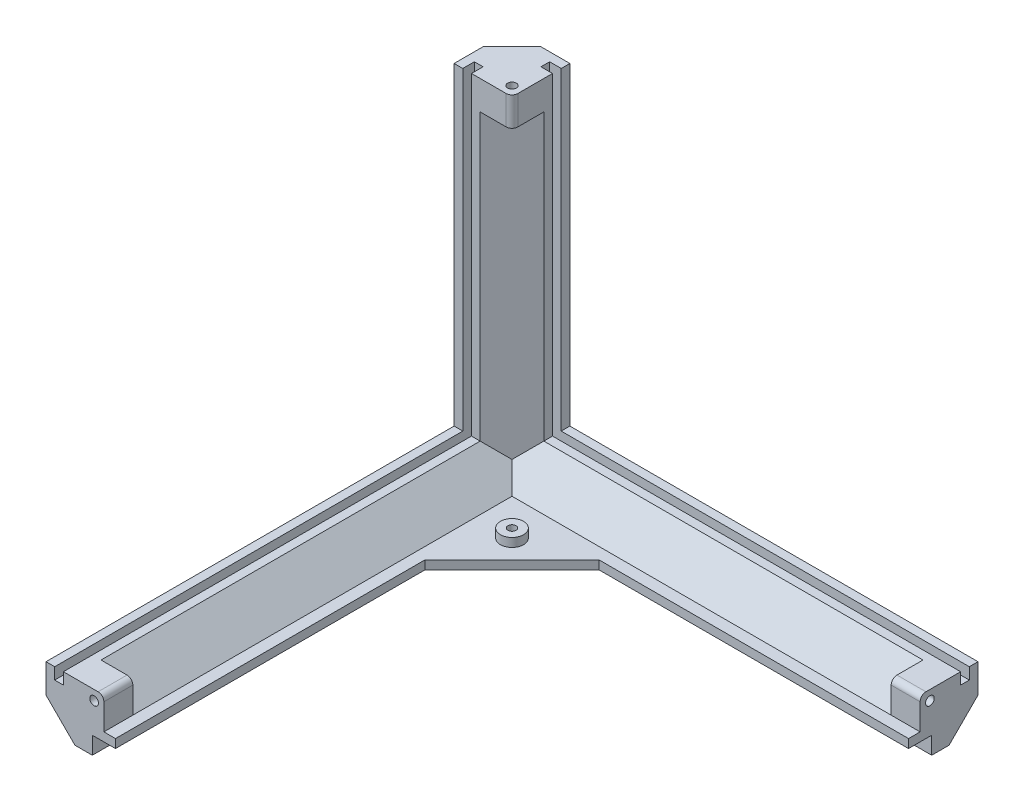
ISO-10303-21;
HEADER;
FILE_DESCRIPTION(('STEP AP214'),'2;1');
FILE_NAME('part.step','',(''),(''),'','','');
FILE_SCHEMA(('AUTOMOTIVE_DESIGN { 1 0 10303 214 1 1 1 1 }'));
ENDSEC;
DATA;
#1=APPLICATION_CONTEXT('core data for automotive mechanical design processes');
#2=APPLICATION_PROTOCOL_DEFINITION('international standard','automotive_design',2000,#1);
#3=PRODUCT_CONTEXT('',#1,'mechanical');
#4=PRODUCT('Part','Part','',(#3));
#5=PRODUCT_RELATED_PRODUCT_CATEGORY('part','',(#4));
#6=PRODUCT_DEFINITION_FORMATION('','',#4);
#7=PRODUCT_DEFINITION_CONTEXT('part definition',#1,'design');
#8=PRODUCT_DEFINITION('design','',#6,#7);
#9=PRODUCT_DEFINITION_SHAPE('','',#8);
#10=(LENGTH_UNIT() NAMED_UNIT(*) SI_UNIT(.MILLI.,.METRE.));
#11=(NAMED_UNIT(*) PLANE_ANGLE_UNIT() SI_UNIT($,.RADIAN.));
#12=(NAMED_UNIT(*) SI_UNIT($,.STERADIAN.) SOLID_ANGLE_UNIT());
#13=UNCERTAINTY_MEASURE_WITH_UNIT(LENGTH_MEASURE(1.E-05),#10,'distance_accuracy_value','');
#14=(GEOMETRIC_REPRESENTATION_CONTEXT(3) GLOBAL_UNCERTAINTY_ASSIGNED_CONTEXT((#13)) GLOBAL_UNIT_ASSIGNED_CONTEXT((#10,
#11,#12)) REPRESENTATION_CONTEXT('',''));
#15=CARTESIAN_POINT('',(0.,0.,0.));
#16=DIRECTION('',(0.,0.,1.));
#17=DIRECTION('',(1.,0.,0.));
#18=AXIS2_PLACEMENT_3D('',#15,#16,#17);
#19=CARTESIAN_POINT('',(100.942130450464,-11.,10.5477331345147));
#20=DIRECTION('',(0.,-1.,0.));
#21=DIRECTION('',(0.,0.,-1.));
#22=AXIS2_PLACEMENT_3D('',#19,#20,#21);
#23=PLANE('',#22);
#24=DIRECTION('',(-1.,0.,0.));
#25=VECTOR('',#24,1.);
#26=CARTESIAN_POINT('',(100.942130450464,-11.,6.54773313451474));
#27=LINE('',#26,#25);
#28=CARTESIAN_POINT('',(100.942130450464,-11.,6.54773313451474));
#29=VERTEX_POINT('',#28);
#30=CARTESIAN_POINT('',(90.9421304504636,-11.,6.54773313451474));
#31=VERTEX_POINT('',#30);
#32=EDGE_CURVE('E512',#29,#31,#27,.T.);
#33=ORIENTED_EDGE('',*,*,#32,.T.);
#34=CARTESIAN_POINT('',(-40.0578695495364,-11.,6.54773313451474));
#35=VERTEX_POINT('',#34);
#36=EDGE_CURVE('E511',#31,#35,#27,.T.);
#37=ORIENTED_EDGE('',*,*,#36,.T.);
#38=DIRECTION('',(0.,0.,-1.));
#39=VECTOR('',#38,1.);
#40=CARTESIAN_POINT('',(-40.0578695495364,-11.,147.547733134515));
#41=LINE('',#40,#39);
#42=CARTESIAN_POINT('',(-40.0578695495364,-11.,137.547733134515));
#43=VERTEX_POINT('',#42);
#44=EDGE_CURVE('E556',#43,#35,#41,.T.);
#45=ORIENTED_EDGE('',*,*,#44,.F.);
#46=CARTESIAN_POINT('',(-40.0578695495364,-11.,147.547733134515));
#47=VERTEX_POINT('',#46);
#48=EDGE_CURVE('E557',#47,#43,#41,.T.);
#49=ORIENTED_EDGE('',*,*,#48,.F.);
#50=DIRECTION('',(-1.,0.,0.));
#51=VECTOR('',#50,1.);
#52=CARTESIAN_POINT('',(-36.0578695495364,-11.,147.547733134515));
#53=LINE('',#52,#51);
#54=CARTESIAN_POINT('',(-36.0578695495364,-11.,147.547733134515));
#55=VERTEX_POINT('',#54);
#56=EDGE_CURVE('E776',#55,#47,#53,.T.);
#57=ORIENTED_EDGE('',*,*,#56,.F.);
#58=DIRECTION('',(0.,0.,1.));
#59=VECTOR('',#58,1.);
#60=CARTESIAN_POINT('',(-36.0578695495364,-11.,10.5477331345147));
#61=LINE('',#60,#59);
#62=CARTESIAN_POINT('',(-36.0578695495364,-11.,40.547733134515));
#63=VERTEX_POINT('',#62);
#64=EDGE_CURVE('E769',#63,#55,#61,.T.);
#65=ORIENTED_EDGE('',*,*,#64,.F.);
#66=DIRECTION('',(-0.707106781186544,0.,0.707106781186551));
#67=VECTOR('',#66,1.);
#68=CARTESIAN_POINT('',(47.442130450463,-11.,-42.9522668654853));
#69=LINE('',#68,#67);
#70=CARTESIAN_POINT('',(-6.05786954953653,-11.,10.5477331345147));
#71=VERTEX_POINT('',#70);
#72=EDGE_CURVE('E376',#63,#71,#69,.F.);
#73=ORIENTED_EDGE('',*,*,#72,.T.);
#74=DIRECTION('',(-1.,0.,0.));
#75=VECTOR('',#74,1.);
#76=CARTESIAN_POINT('',(100.942130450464,-11.,10.5477331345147));
#77=LINE('',#76,#75);
#78=CARTESIAN_POINT('',(100.942130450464,-11.,10.5477331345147));
#79=VERTEX_POINT('',#78);
#80=EDGE_CURVE('E786',#79,#71,#77,.T.);
#81=ORIENTED_EDGE('',*,*,#80,.F.);
#82=DIRECTION('',(0.,0.,-1.));
#83=VECTOR('',#82,1.);
#84=CARTESIAN_POINT('',(100.942130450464,-11.,10.5477331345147));
#85=LINE('',#84,#83);
#86=EDGE_CURVE('E790',#79,#29,#85,.T.);
#87=ORIENTED_EDGE('',*,*,#86,.T.);
#88=EDGE_LOOP('',(#33,#37,#45,#49,#57,#65,#73,#81,#87));
#89=FACE_BOUND('',#88,.T.);
#90=CARTESIAN_POINT('',(-27.5578695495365,-11.,19.0477331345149));
#91=DIRECTION('',(0.,-1.,0.));
#92=DIRECTION('',(0.,0.,-1.));
#93=AXIS2_PLACEMENT_3D('',#90,#91,#92);
#94=CIRCLE('',#93,4.);
#95=CARTESIAN_POINT('',(-27.5578695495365,-11.,15.0477331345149));
#96=VERTEX_POINT('',#95);
#97=EDGE_CURVE('E11',#96,#96,#94,.F.);
#98=ORIENTED_EDGE('',*,*,#97,.F.);
#99=EDGE_LOOP('',(#98));
#100=FACE_BOUND('',#99,.T.);
#101=ADVANCED_FACE('F39',(#89,#100),#23,.F.);
#102=CARTESIAN_POINT('',(-40.0578695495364,108.5,-4.45226686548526));
#103=DIRECTION('',(-0.707106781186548,0.,-0.707106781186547));
#104=DIRECTION('',(-0.707106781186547,0.,0.707106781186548));
#105=AXIS2_PLACEMENT_3D('',#102,#103,#104);
#106=PLANE('',#105);
#107=DIRECTION('',(-0.707106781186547,0.,0.707106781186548));
#108=VECTOR('',#107,1.);
#109=CARTESIAN_POINT('',(-40.0578695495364,98.5,-4.45226686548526));
#110=LINE('',#109,#108);
#111=CARTESIAN_POINT('',(-40.0578695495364,98.5,-4.45226686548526));
#112=VERTEX_POINT('',#111);
#113=CARTESIAN_POINT('',(-51.0578695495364,98.5,6.54773313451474));
#114=VERTEX_POINT('',#113);
#115=EDGE_CURVE('E300',#112,#114,#110,.T.);
#116=ORIENTED_EDGE('',*,*,#115,.T.);
#117=DIRECTION('',(0.,-1.,0.));
#118=VECTOR('',#117,1.);
#119=CARTESIAN_POINT('',(-51.0578695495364,108.5,6.54773313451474));
#120=LINE('',#119,#118);
#121=CARTESIAN_POINT('',(-51.0578695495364,0.,6.54773313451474));
#122=VERTEX_POINT('',#121);
#123=EDGE_CURVE('E313',#114,#122,#120,.T.);
#124=ORIENTED_EDGE('',*,*,#123,.T.);
#125=DIRECTION('',(-0.577350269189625,0.577350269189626,0.577350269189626));
#126=VECTOR('',#125,1.);
#127=CARTESIAN_POINT('',(-79.8912028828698,28.8333333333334,35.3810664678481));
#128=LINE('',#127,#126);
#129=CARTESIAN_POINT('',(-45.5578695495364,-5.49999999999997,1.04773313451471));
#130=VERTEX_POINT('',#129);
#131=EDGE_CURVE('E639',#130,#122,#128,.T.);
#132=ORIENTED_EDGE('',*,*,#131,.F.);
#133=DIRECTION('',(-0.577350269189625,-0.577350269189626,0.577350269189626));
#134=VECTOR('',#133,1.);
#135=CARTESIAN_POINT('',(-3.89120288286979,36.1666666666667,-40.6189335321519));
#136=LINE('',#135,#134);
#137=CARTESIAN_POINT('',(-40.0578695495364,0.,-4.45226686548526));
#138=VERTEX_POINT('',#137);
#139=EDGE_CURVE('E645',#138,#130,#136,.T.);
#140=ORIENTED_EDGE('',*,*,#139,.F.);
#141=DIRECTION('',(0.,-1.,0.));
#142=VECTOR('',#141,1.);
#143=CARTESIAN_POINT('',(-40.0578695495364,108.5,-4.45226686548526));
#144=LINE('',#143,#142);
#145=EDGE_CURVE('E316',#112,#138,#144,.T.);
#146=ORIENTED_EDGE('',*,*,#145,.F.);
#147=EDGE_LOOP('',(#116,#124,#132,#140,#146));
#148=FACE_BOUND('',#147,.T.);
#149=ADVANCED_FACE('F311',(#148),#106,.F.);
#150=CARTESIAN_POINT('',(100.942130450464,-11.,6.54773313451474));
#151=DIRECTION('',(0.,-0.707106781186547,-0.707106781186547));
#152=DIRECTION('',(0.,0.707106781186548,-0.707106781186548));
#153=AXIS2_PLACEMENT_3D('',#150,#151,#152);
#154=PLANE('',#153);
#155=DIRECTION('',(0.,0.707106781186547,-0.707106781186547));
#156=VECTOR('',#155,1.);
#157=CARTESIAN_POINT('',(90.9421304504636,-11.,6.54773313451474));
#158=LINE('',#157,#156);
#159=CARTESIAN_POINT('',(90.9421304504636,0.,-4.45226686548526));
#160=VERTEX_POINT('',#159);
#161=EDGE_CURVE('E742',#31,#160,#158,.T.);
#162=ORIENTED_EDGE('',*,*,#161,.T.);
#163=DIRECTION('',(-1.,0.,0.));
#164=VECTOR('',#163,1.);
#165=CARTESIAN_POINT('',(100.942130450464,0.,-4.45226686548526));
#166=LINE('',#165,#164);
#167=EDGE_CURVE('E479',#160,#138,#166,.T.);
#168=ORIENTED_EDGE('',*,*,#167,.T.);
#169=ORIENTED_EDGE('',*,*,#139,.T.);
#170=DIRECTION('',(-0.577350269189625,0.577350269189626,-0.577350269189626));
#171=VECTOR('',#170,1.);
#172=CARTESIAN_POINT('',(6.94213045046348,-58.,53.5477331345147));
#173=LINE('',#172,#171);
#174=EDGE_CURVE('E642',#35,#130,#173,.T.);
#175=ORIENTED_EDGE('',*,*,#174,.F.);
#176=ORIENTED_EDGE('',*,*,#36,.F.);
#177=EDGE_LOOP('',(#162,#168,#169,#175,#176));
#178=FACE_BOUND('',#177,.T.);
#179=ADVANCED_FACE('F902',(#178),#154,.F.);
#180=CARTESIAN_POINT('',(-40.0578695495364,108.5,-7.45226686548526));
#181=DIRECTION('',(-1.,0.,0.));
#182=DIRECTION('',(0.,0.,1.));
#183=AXIS2_PLACEMENT_3D('',#180,#181,#182);
#184=PLANE('',#183);
#185=DIRECTION('',(0.,0.,1.));
#186=VECTOR('',#185,1.);
#187=CARTESIAN_POINT('',(-40.0578695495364,0.,-10.4522668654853));
#188=LINE('',#187,#186);
#189=CARTESIAN_POINT('',(-40.0578695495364,0.,-13.4522668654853));
#190=VERTEX_POINT('',#189);
#191=CARTESIAN_POINT('',(-40.0578695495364,0.,-10.4522668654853));
#192=VERTEX_POINT('',#191);
#193=EDGE_CURVE('E664',#190,#192,#188,.T.);
#194=ORIENTED_EDGE('',*,*,#193,.F.);
#195=DIRECTION('',(0.,-1.,0.));
#196=VECTOR('',#195,1.);
#197=CARTESIAN_POINT('',(-40.0578695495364,108.5,-13.4522668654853));
#198=LINE('',#197,#196);
#199=CARTESIAN_POINT('',(-40.0578695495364,108.5,-13.4522668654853));
#200=VERTEX_POINT('',#199);
#201=EDGE_CURVE('E354',#200,#190,#198,.T.);
#202=ORIENTED_EDGE('',*,*,#201,.F.);
#203=DIRECTION('',(0.,0.,-1.));
#204=VECTOR('',#203,1.);
#205=CARTESIAN_POINT('',(-40.0578695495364,108.5,-13.4522668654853));
#206=LINE('',#205,#204);
#207=CARTESIAN_POINT('',(-40.0578695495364,108.5,-10.4522668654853));
#208=VERTEX_POINT('',#207);
#209=EDGE_CURVE('E597',#208,#200,#206,.T.);
#210=ORIENTED_EDGE('',*,*,#209,.F.);
#211=DIRECTION('',(0.,-1.,0.));
#212=VECTOR('',#211,1.);
#213=CARTESIAN_POINT('',(-40.0578695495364,108.5,-10.4522668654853));
#214=LINE('',#213,#212);
#215=EDGE_CURVE('E358',#208,#192,#214,.T.);
#216=ORIENTED_EDGE('',*,*,#215,.T.);
#217=EDGE_LOOP('',(#194,#202,#210,#216));
#218=FACE_BOUND('',#217,.T.);
#219=ADVANCED_FACE('F722',(#218),#184,.F.);
#220=DIRECTION('',(0.,0.,-1.));
#221=VECTOR('',#220,1.);
#222=CARTESIAN_POINT('',(-40.0578695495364,108.5,-7.45226686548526));
#223=LINE('',#222,#221);
#224=CARTESIAN_POINT('',(-40.0578695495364,108.5,4.54773313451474));
#225=VERTEX_POINT('',#224);
#226=CARTESIAN_POINT('',(-40.0578695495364,108.5,-7.45226686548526));
#227=VERTEX_POINT('',#226);
#228=EDGE_CURVE('E437',#225,#227,#223,.T.);
#229=ORIENTED_EDGE('',*,*,#228,.F.);
#230=DIRECTION('',(0.,1.,0.));
#231=VECTOR('',#230,1.);
#232=CARTESIAN_POINT('',(-40.0578695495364,108.5,4.54773313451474));
#233=LINE('',#232,#231);
#234=CARTESIAN_POINT('',(-40.0578695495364,98.5,4.54773313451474));
#235=VERTEX_POINT('',#234);
#236=EDGE_CURVE('E55',#225,#235,#233,.F.);
#237=ORIENTED_EDGE('',*,*,#236,.T.);
#238=DIRECTION('',(0.,0.,-1.));
#239=VECTOR('',#238,1.);
#240=CARTESIAN_POINT('',(-40.0578695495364,98.5,6.54773313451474));
#241=LINE('',#240,#239);
#242=EDGE_CURVE('E308',#235,#112,#241,.T.);
#243=ORIENTED_EDGE('',*,*,#242,.T.);
#244=ORIENTED_EDGE('',*,*,#145,.T.);
#245=DIRECTION('',(0.,0.,1.));
#246=VECTOR('',#245,1.);
#247=CARTESIAN_POINT('',(-40.0578695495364,0.,-4.45226686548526));
#248=LINE('',#247,#246);
#249=CARTESIAN_POINT('',(-40.0578695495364,0.,-7.45226686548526));
#250=VERTEX_POINT('',#249);
#251=EDGE_CURVE('E474',#250,#138,#248,.T.);
#252=ORIENTED_EDGE('',*,*,#251,.F.);
#253=DIRECTION('',(0.,-1.,0.));
#254=VECTOR('',#253,1.);
#255=CARTESIAN_POINT('',(-40.0578695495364,108.5,-7.45226686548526));
#256=LINE('',#255,#254);
#257=EDGE_CURVE('E331',#227,#250,#256,.T.);
#258=ORIENTED_EDGE('',*,*,#257,.F.);
#259=EDGE_LOOP('',(#229,#237,#243,#244,#252,#258));
#260=FACE_BOUND('',#259,.T.);
#261=ADVANCED_FACE('F1013',(#260),#184,.F.);
#262=CARTESIAN_POINT('',(-54.0578695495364,108.5,6.54773313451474));
#263=DIRECTION('',(0.,0.,-1.));
#264=DIRECTION('',(-1.,0.,0.));
#265=AXIS2_PLACEMENT_3D('',#262,#263,#264);
#266=PLANE('',#265);
#267=DIRECTION('',(1.,0.,0.));
#268=VECTOR('',#267,1.);
#269=CARTESIAN_POINT('',(-51.0578695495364,98.5,6.54773313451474));
#270=LINE('',#269,#268);
#271=CARTESIAN_POINT('',(-42.0578695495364,98.5,6.54773313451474));
#272=VERTEX_POINT('',#271);
#273=EDGE_CURVE('E297',#114,#272,#270,.T.);
#274=ORIENTED_EDGE('',*,*,#273,.T.);
#275=DIRECTION('',(0.,1.,0.));
#276=VECTOR('',#275,1.);
#277=CARTESIAN_POINT('',(-42.0578695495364,108.5,6.54773313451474));
#278=LINE('',#277,#276);
#279=CARTESIAN_POINT('',(-42.0578695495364,108.5,6.54773313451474));
#280=VERTEX_POINT('',#279);
#281=EDGE_CURVE('E421',#272,#280,#278,.T.);
#282=ORIENTED_EDGE('',*,*,#281,.T.);
#283=DIRECTION('',(1.,0.,0.));
#284=VECTOR('',#283,1.);
#285=CARTESIAN_POINT('',(-54.0578695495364,108.5,6.54773313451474));
#286=LINE('',#285,#284);
#287=CARTESIAN_POINT('',(-54.0578695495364,108.5,6.54773313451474));
#288=VERTEX_POINT('',#287);
#289=EDGE_CURVE('E429',#288,#280,#286,.T.);
#290=ORIENTED_EDGE('',*,*,#289,.F.);
#291=DIRECTION('',(0.,-1.,0.));
#292=VECTOR('',#291,1.);
#293=CARTESIAN_POINT('',(-54.0578695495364,108.5,6.54773313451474));
#294=LINE('',#293,#292);
#295=CARTESIAN_POINT('',(-54.0578695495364,0.,6.54773313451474));
#296=VERTEX_POINT('',#295);
#297=EDGE_CURVE('E325',#288,#296,#294,.T.);
#298=ORIENTED_EDGE('',*,*,#297,.T.);
#299=DIRECTION('',(-1.,0.,0.));
#300=VECTOR('',#299,1.);
#301=CARTESIAN_POINT('',(-54.0578695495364,0.,6.54773313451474));
#302=LINE('',#301,#300);
#303=EDGE_CURVE('E323',#122,#296,#302,.T.);
#304=ORIENTED_EDGE('',*,*,#303,.F.);
#305=ORIENTED_EDGE('',*,*,#123,.F.);
#306=EDGE_LOOP('',(#274,#282,#290,#298,#304,#305));
#307=FACE_BOUND('',#306,.T.);
#308=ADVANCED_FACE('F321',(#307),#266,.F.);
#309=DIRECTION('',(-1.,0.,0.));
#310=VECTOR('',#309,1.);
#311=CARTESIAN_POINT('',(-57.0578695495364,0.,6.54773313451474));
#312=LINE('',#311,#310);
#313=CARTESIAN_POINT('',(-57.0578695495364,0.,6.54773313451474));
#314=VERTEX_POINT('',#313);
#315=CARTESIAN_POINT('',(-60.0578695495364,0.,6.54773313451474));
#316=VERTEX_POINT('',#315);
#317=EDGE_CURVE('E520',#314,#316,#312,.T.);
#318=ORIENTED_EDGE('',*,*,#317,.F.);
#319=DIRECTION('',(0.,-1.,0.));
#320=VECTOR('',#319,1.);
#321=CARTESIAN_POINT('',(-57.0578695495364,108.5,6.54773313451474));
#322=LINE('',#321,#320);
#323=CARTESIAN_POINT('',(-57.0578695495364,108.5,6.54773313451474));
#324=VERTEX_POINT('',#323);
#325=EDGE_CURVE('E340',#324,#314,#322,.T.);
#326=ORIENTED_EDGE('',*,*,#325,.F.);
#327=DIRECTION('',(1.,0.,0.));
#328=VECTOR('',#327,1.);
#329=CARTESIAN_POINT('',(-60.0578695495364,108.5,6.54773313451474));
#330=LINE('',#329,#328);
#331=CARTESIAN_POINT('',(-60.0578695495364,108.5,6.54773313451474));
#332=VERTEX_POINT('',#331);
#333=EDGE_CURVE('E609',#332,#324,#330,.T.);
#334=ORIENTED_EDGE('',*,*,#333,.F.);
#335=DIRECTION('',(0.,-1.,0.));
#336=VECTOR('',#335,1.);
#337=CARTESIAN_POINT('',(-60.0578695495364,108.5,6.54773313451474));
#338=LINE('',#337,#336);
#339=EDGE_CURVE('E344',#332,#316,#338,.T.);
#340=ORIENTED_EDGE('',*,*,#339,.T.);
#341=EDGE_LOOP('',(#318,#326,#334,#340));
#342=FACE_BOUND('',#341,.T.);
#343=ADVANCED_FACE('F836',(#342),#266,.F.);
#344=CARTESIAN_POINT('',(-40.0578695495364,108.5,-10.4522668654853));
#345=DIRECTION('',(0.,0.,-1.));
#346=DIRECTION('',(-1.,0.,0.));
#347=AXIS2_PLACEMENT_3D('',#344,#345,#346);
#348=PLANE('',#347);
#349=DIRECTION('',(0.,-1.,0.));
#350=VECTOR('',#349,1.);
#351=CARTESIAN_POINT('',(-44.0578695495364,108.5,-10.4522668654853));
#352=LINE('',#351,#350);
#353=CARTESIAN_POINT('',(-44.0578695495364,108.5,-10.4522668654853));
#354=VERTEX_POINT('',#353);
#355=CARTESIAN_POINT('',(-44.0578695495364,-4.,-10.4522668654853));
#356=VERTEX_POINT('',#355);
#357=EDGE_CURVE('E452',#354,#356,#352,.T.);
#358=ORIENTED_EDGE('',*,*,#357,.T.);
#359=DIRECTION('',(-1.,0.,0.));
#360=VECTOR('',#359,1.);
#361=CARTESIAN_POINT('',(100.942130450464,-4.,-10.4522668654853));
#362=LINE('',#361,#360);
#363=CARTESIAN_POINT('',(100.942130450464,-4.,-10.4522668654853));
#364=VERTEX_POINT('',#363);
#365=EDGE_CURVE('E484',#364,#356,#362,.T.);
#366=ORIENTED_EDGE('',*,*,#365,.F.);
#367=DIRECTION('',(0.,-1.,0.));
#368=VECTOR('',#367,1.);
#369=CARTESIAN_POINT('',(100.942130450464,-4.,-10.4522668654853));
#370=LINE('',#369,#368);
#371=CARTESIAN_POINT('',(100.942130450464,0.,-10.4522668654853));
#372=VERTEX_POINT('',#371);
#373=EDGE_CURVE('E683',#372,#364,#370,.T.);
#374=ORIENTED_EDGE('',*,*,#373,.F.);
#375=DIRECTION('',(-1.,0.,0.));
#376=VECTOR('',#375,1.);
#377=CARTESIAN_POINT('',(100.942130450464,0.,-10.4522668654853));
#378=LINE('',#377,#376);
#379=EDGE_CURVE('E493',#372,#192,#378,.T.);
#380=ORIENTED_EDGE('',*,*,#379,.T.);
#381=ORIENTED_EDGE('',*,*,#215,.F.);
#382=DIRECTION('',(1.,0.,0.));
#383=VECTOR('',#382,1.);
#384=CARTESIAN_POINT('',(-40.0578695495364,108.5,-10.4522668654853));
#385=LINE('',#384,#383);
#386=EDGE_CURVE('E593',#354,#208,#385,.T.);
#387=ORIENTED_EDGE('',*,*,#386,.F.);
#388=EDGE_LOOP('',(#358,#366,#374,#380,#381,#387));
#389=FACE_BOUND('',#388,.T.);
#390=ADVANCED_FACE('F707',(#389),#348,.F.);
#391=CARTESIAN_POINT('',(-50.0578695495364,108.5,-13.4522668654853));
#392=DIRECTION('',(0.,0.,1.));
#393=DIRECTION('',(1.,0.,0.));
#394=AXIS2_PLACEMENT_3D('',#391,#392,#393);
#395=PLANE('',#394);
#396=DIRECTION('',(-1.,0.,0.));
#397=VECTOR('',#396,1.);
#398=CARTESIAN_POINT('',(100.942130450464,-10.,-13.4522668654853));
#399=LINE('',#398,#397);
#400=CARTESIAN_POINT('',(100.942130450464,-10.,-13.4522668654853));
#401=VERTEX_POINT('',#400);
#402=CARTESIAN_POINT('',(-50.0578695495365,-10.,-13.4522668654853));
#403=VERTEX_POINT('',#402);
#404=EDGE_CURVE('E501',#401,#403,#399,.T.);
#405=ORIENTED_EDGE('',*,*,#404,.T.);
#406=DIRECTION('',(0.,-1.,0.));
#407=VECTOR('',#406,1.);
#408=CARTESIAN_POINT('',(-50.0578695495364,108.5,-13.4522668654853));
#409=LINE('',#408,#407);
#410=CARTESIAN_POINT('',(-50.0578695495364,108.5,-13.4522668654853));
#411=VERTEX_POINT('',#410);
#412=EDGE_CURVE('E350',#411,#403,#409,.T.);
#413=ORIENTED_EDGE('',*,*,#412,.F.);
#414=DIRECTION('',(-1.,0.,0.));
#415=VECTOR('',#414,1.);
#416=CARTESIAN_POINT('',(-50.0578695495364,108.5,-13.4522668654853));
#417=LINE('',#416,#415);
#418=EDGE_CURVE('E600',#200,#411,#417,.T.);
#419=ORIENTED_EDGE('',*,*,#418,.F.);
#420=ORIENTED_EDGE('',*,*,#201,.T.);
#421=DIRECTION('',(-1.,0.,0.));
#422=VECTOR('',#421,1.);
#423=CARTESIAN_POINT('',(100.942130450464,0.,-13.4522668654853));
#424=LINE('',#423,#422);
#425=CARTESIAN_POINT('',(100.942130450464,0.,-13.4522668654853));
#426=VERTEX_POINT('',#425);
#427=EDGE_CURVE('E497',#426,#190,#424,.T.);
#428=ORIENTED_EDGE('',*,*,#427,.F.);
#429=DIRECTION('',(0.,1.,0.));
#430=VECTOR('',#429,1.);
#431=CARTESIAN_POINT('',(100.942130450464,0.,-13.4522668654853));
#432=LINE('',#431,#430);
#433=EDGE_CURVE('E677',#401,#426,#432,.T.);
#434=ORIENTED_EDGE('',*,*,#433,.F.);
#435=EDGE_LOOP('',(#405,#413,#419,#420,#428,#434));
#436=FACE_BOUND('',#435,.T.);
#437=ADVANCED_FACE('F719',(#436),#395,.F.);
#438=CARTESIAN_POINT('',(-60.0578695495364,108.5,-3.45226686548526));
#439=DIRECTION('',(0.707106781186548,0.,0.707106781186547));
#440=DIRECTION('',(0.707106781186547,0.,-0.707106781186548));
#441=AXIS2_PLACEMENT_3D('',#438,#439,#440);
#442=PLANE('',#441);
#443=ORIENTED_EDGE('',*,*,#412,.T.);
#444=DIRECTION('',(-0.577350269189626,-0.577350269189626,0.577350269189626));
#445=VECTOR('',#444,1.);
#446=CARTESIAN_POINT('',(-17.2245362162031,22.8333333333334,-46.2856001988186));
#447=LINE('',#446,#445);
#448=CARTESIAN_POINT('',(-55.0578695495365,-15.,-8.45226686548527));
#449=VERTEX_POINT('',#448);
#450=EDGE_CURVE('E660',#403,#449,#447,.T.);
#451=ORIENTED_EDGE('',*,*,#450,.T.);
#452=DIRECTION('',(0.577350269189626,-0.577350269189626,-0.577350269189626));
#453=VECTOR('',#452,1.);
#454=CARTESIAN_POINT('',(-103.724536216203,33.6666666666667,40.2143998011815));
#455=LINE('',#454,#453);
#456=CARTESIAN_POINT('',(-60.0578695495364,-10.,-3.45226686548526));
#457=VERTEX_POINT('',#456);
#458=EDGE_CURVE('E361',#457,#449,#455,.T.);
#459=ORIENTED_EDGE('',*,*,#458,.F.);
#460=DIRECTION('',(0.,-1.,0.));
#461=VECTOR('',#460,1.);
#462=CARTESIAN_POINT('',(-60.0578695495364,108.5,-3.45226686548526));
#463=LINE('',#462,#461);
#464=CARTESIAN_POINT('',(-60.0578695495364,108.5,-3.45226686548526));
#465=VERTEX_POINT('',#464);
#466=EDGE_CURVE('E347',#465,#457,#463,.T.);
#467=ORIENTED_EDGE('',*,*,#466,.F.);
#468=DIRECTION('',(-0.707106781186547,0.,0.707106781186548));
#469=VECTOR('',#468,1.);
#470=CARTESIAN_POINT('',(-60.0578695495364,108.5,-3.45226686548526));
#471=LINE('',#470,#469);
#472=EDGE_CURVE('E603',#411,#465,#471,.T.);
#473=ORIENTED_EDGE('',*,*,#472,.F.);
#474=EDGE_LOOP('',(#443,#451,#459,#467,#473));
#475=FACE_BOUND('',#474,.T.);
#476=ADVANCED_FACE('F826',(#475),#442,.F.);
#477=CARTESIAN_POINT('',(-60.0578695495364,108.5,-3.45226686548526));
#478=DIRECTION('',(1.,0.,0.));
#479=DIRECTION('',(0.,0.,-1.));
#480=AXIS2_PLACEMENT_3D('',#477,#478,#479);
#481=PLANE('',#480);
#482=ORIENTED_EDGE('',*,*,#466,.T.);
#483=DIRECTION('',(0.,0.,-1.));
#484=VECTOR('',#483,1.);
#485=CARTESIAN_POINT('',(-60.0578695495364,-10.,147.547733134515));
#486=LINE('',#485,#484);
#487=CARTESIAN_POINT('',(-60.0578695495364,-10.,147.547733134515));
#488=VERTEX_POINT('',#487);
#489=EDGE_CURVE('E569',#488,#457,#486,.T.);
#490=ORIENTED_EDGE('',*,*,#489,.F.);
#491=DIRECTION('',(0.,-1.,0.));
#492=VECTOR('',#491,1.);
#493=CARTESIAN_POINT('',(-60.0578695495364,0.,147.547733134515));
#494=LINE('',#493,#492);
#495=CARTESIAN_POINT('',(-60.0578695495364,0.,147.547733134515));
#496=VERTEX_POINT('',#495);
#497=EDGE_CURVE('E532',#496,#488,#494,.T.);
#498=ORIENTED_EDGE('',*,*,#497,.F.);
#499=DIRECTION('',(0.,0.,-1.));
#500=VECTOR('',#499,1.);
#501=CARTESIAN_POINT('',(-60.0578695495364,0.,147.547733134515));
#502=LINE('',#501,#500);
#503=EDGE_CURVE('E573',#496,#316,#502,.T.);
#504=ORIENTED_EDGE('',*,*,#503,.T.);
#505=ORIENTED_EDGE('',*,*,#339,.F.);
#506=DIRECTION('',(0.,0.,1.));
#507=VECTOR('',#506,1.);
#508=CARTESIAN_POINT('',(-60.0578695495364,108.5,-3.45226686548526));
#509=LINE('',#508,#507);
#510=EDGE_CURVE('E606',#465,#332,#509,.T.);
#511=ORIENTED_EDGE('',*,*,#510,.F.);
#512=EDGE_LOOP('',(#482,#490,#498,#504,#505,#511));
#513=FACE_BOUND('',#512,.T.);
#514=ADVANCED_FACE('F833',(#513),#481,.F.);
#515=CARTESIAN_POINT('',(-57.0578695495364,108.5,6.54773313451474));
#516=DIRECTION('',(-1.,0.,0.));
#517=DIRECTION('',(0.,0.,1.));
#518=AXIS2_PLACEMENT_3D('',#515,#516,#517);
#519=PLANE('',#518);
#520=ORIENTED_EDGE('',*,*,#325,.T.);
#521=DIRECTION('',(0.,0.,-1.));
#522=VECTOR('',#521,1.);
#523=CARTESIAN_POINT('',(-57.0578695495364,0.,147.547733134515));
#524=LINE('',#523,#522);
#525=CARTESIAN_POINT('',(-57.0578695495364,0.,147.547733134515));
#526=VERTEX_POINT('',#525);
#527=EDGE_CURVE('E577',#526,#314,#524,.T.);
#528=ORIENTED_EDGE('',*,*,#527,.F.);
#529=DIRECTION('',(0.,1.,0.));
#530=VECTOR('',#529,1.);
#531=CARTESIAN_POINT('',(-57.0578695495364,0.,147.547733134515));
#532=LINE('',#531,#530);
#533=CARTESIAN_POINT('',(-57.0578695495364,-4.,147.547733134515));
#534=VERTEX_POINT('',#533);
#535=EDGE_CURVE('E526',#534,#526,#532,.T.);
#536=ORIENTED_EDGE('',*,*,#535,.F.);
#537=DIRECTION('',(0.,0.,-1.));
#538=VECTOR('',#537,1.);
#539=CARTESIAN_POINT('',(-57.0578695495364,-4.,147.547733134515));
#540=LINE('',#539,#538);
#541=CARTESIAN_POINT('',(-57.0578695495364,-3.99999999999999,2.54773313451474));
#542=VERTEX_POINT('',#541);
#543=EDGE_CURVE('E581',#534,#542,#540,.T.);
#544=ORIENTED_EDGE('',*,*,#543,.T.);
#545=DIRECTION('',(0.,-1.,0.));
#546=VECTOR('',#545,1.);
#547=CARTESIAN_POINT('',(-57.0578695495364,108.5,2.54773313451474));
#548=LINE('',#547,#546);
#549=CARTESIAN_POINT('',(-57.0578695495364,108.5,2.54773313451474));
#550=VERTEX_POINT('',#549);
#551=EDGE_CURVE('E337',#550,#542,#548,.T.);
#552=ORIENTED_EDGE('',*,*,#551,.F.);
#553=DIRECTION('',(0.,0.,-1.));
#554=VECTOR('',#553,1.);
#555=CARTESIAN_POINT('',(-57.0578695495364,108.5,6.54773313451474));
#556=LINE('',#555,#554);
#557=EDGE_CURVE('E612',#324,#550,#556,.T.);
#558=ORIENTED_EDGE('',*,*,#557,.F.);
#559=EDGE_LOOP('',(#520,#528,#536,#544,#552,#558));
#560=FACE_BOUND('',#559,.T.);
#561=ADVANCED_FACE('F839',(#560),#519,.F.);
#562=CARTESIAN_POINT('',(-57.0578695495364,108.5,2.54773313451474));
#563=DIRECTION('',(0.,0.,-1.));
#564=DIRECTION('',(-1.,0.,0.));
#565=AXIS2_PLACEMENT_3D('',#562,#563,#564);
#566=PLANE('',#565);
#567=ORIENTED_EDGE('',*,*,#551,.T.);
#568=DIRECTION('',(-1.,0.,0.));
#569=VECTOR('',#568,1.);
#570=CARTESIAN_POINT('',(-57.0578695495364,-3.99999999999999,2.54773313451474));
#571=LINE('',#570,#569);
#572=CARTESIAN_POINT('',(-54.0578695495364,-3.99999999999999,2.54773313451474));
#573=VERTEX_POINT('',#572);
#574=EDGE_CURVE('E623',#573,#542,#571,.T.);
#575=ORIENTED_EDGE('',*,*,#574,.F.);
#576=DIRECTION('',(0.,-1.,0.));
#577=VECTOR('',#576,1.);
#578=CARTESIAN_POINT('',(-54.0578695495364,108.5,2.54773313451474));
#579=LINE('',#578,#577);
#580=CARTESIAN_POINT('',(-54.0578695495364,108.5,2.54773313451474));
#581=VERTEX_POINT('',#580);
#582=EDGE_CURVE('E329',#581,#573,#579,.T.);
#583=ORIENTED_EDGE('',*,*,#582,.F.);
#584=DIRECTION('',(1.,0.,0.));
#585=VECTOR('',#584,1.);
#586=CARTESIAN_POINT('',(-57.0578695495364,108.5,2.54773313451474));
#587=LINE('',#586,#585);
#588=EDGE_CURVE('E443',#550,#581,#587,.T.);
#589=ORIENTED_EDGE('',*,*,#588,.F.);
#590=EDGE_LOOP('',(#567,#575,#583,#589));
#591=FACE_BOUND('',#590,.T.);
#592=ADVANCED_FACE('F621',(#591),#566,.F.);
#593=CARTESIAN_POINT('',(-54.0578695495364,108.5,2.54773313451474));
#594=DIRECTION('',(1.,0.,0.));
#595=DIRECTION('',(0.,0.,-1.));
#596=AXIS2_PLACEMENT_3D('',#593,#594,#595);
#597=PLANE('',#596);
#598=ORIENTED_EDGE('',*,*,#582,.T.);
#599=DIRECTION('',(0.,0.,-1.));
#600=VECTOR('',#599,1.);
#601=CARTESIAN_POINT('',(-54.0578695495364,-4.,147.547733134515));
#602=LINE('',#601,#600);
#603=CARTESIAN_POINT('',(-54.0578695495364,-4.,147.547733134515));
#604=VERTEX_POINT('',#603);
#605=EDGE_CURVE('E585',#604,#573,#602,.T.);
#606=ORIENTED_EDGE('',*,*,#605,.F.);
#607=DIRECTION('',(0.,-1.,0.));
#608=VECTOR('',#607,1.);
#609=CARTESIAN_POINT('',(-54.0578695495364,-4.,147.547733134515));
#610=LINE('',#609,#608);
#611=CARTESIAN_POINT('',(-54.0578695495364,0.,147.547733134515));
#612=VERTEX_POINT('',#611);
#613=EDGE_CURVE('E519',#612,#604,#610,.T.);
#614=ORIENTED_EDGE('',*,*,#613,.F.);
#615=DIRECTION('',(0.,0.,-1.));
#616=VECTOR('',#615,1.);
#617=CARTESIAN_POINT('',(-54.0578695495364,0.,147.547733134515));
#618=LINE('',#617,#616);
#619=EDGE_CURVE('E589',#612,#296,#618,.T.);
#620=ORIENTED_EDGE('',*,*,#619,.T.);
#621=ORIENTED_EDGE('',*,*,#297,.F.);
#622=DIRECTION('',(0.,0.,1.));
#623=VECTOR('',#622,1.);
#624=CARTESIAN_POINT('',(-54.0578695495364,108.5,2.54773313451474));
#625=LINE('',#624,#623);
#626=EDGE_CURVE('E434',#581,#288,#625,.T.);
#627=ORIENTED_EDGE('',*,*,#626,.F.);
#628=EDGE_LOOP('',(#598,#606,#614,#620,#621,#627));
#629=FACE_BOUND('',#628,.T.);
#630=ADVANCED_FACE('F626',(#629),#597,.F.);
#631=CARTESIAN_POINT('',(-44.0578695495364,108.5,-7.45226686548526));
#632=DIRECTION('',(0.,0.,1.));
#633=DIRECTION('',(1.,0.,0.));
#634=AXIS2_PLACEMENT_3D('',#631,#632,#633);
#635=PLANE('',#634);
#636=ORIENTED_EDGE('',*,*,#257,.T.);
#637=DIRECTION('',(-1.,0.,0.));
#638=VECTOR('',#637,1.);
#639=CARTESIAN_POINT('',(100.942130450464,0.,-7.45226686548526));
#640=LINE('',#639,#638);
#641=CARTESIAN_POINT('',(100.942130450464,0.,-7.45226686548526));
#642=VERTEX_POINT('',#641);
#643=EDGE_CURVE('E466',#642,#250,#640,.T.);
#644=ORIENTED_EDGE('',*,*,#643,.F.);
#645=DIRECTION('',(0.,1.,0.));
#646=VECTOR('',#645,1.);
#647=CARTESIAN_POINT('',(100.942130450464,0.,-7.45226686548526));
#648=LINE('',#647,#646);
#649=CARTESIAN_POINT('',(100.942130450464,-4.,-7.45226686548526));
#650=VERTEX_POINT('',#649);
#651=EDGE_CURVE('E689',#650,#642,#648,.T.);
#652=ORIENTED_EDGE('',*,*,#651,.F.);
#653=DIRECTION('',(-1.,0.,0.));
#654=VECTOR('',#653,1.);
#655=CARTESIAN_POINT('',(100.942130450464,-4.,-7.45226686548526));
#656=LINE('',#655,#654);
#657=CARTESIAN_POINT('',(-44.0578695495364,-4.,-7.45226686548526));
#658=VERTEX_POINT('',#657);
#659=EDGE_CURVE('E478',#650,#658,#656,.T.);
#660=ORIENTED_EDGE('',*,*,#659,.T.);
#661=DIRECTION('',(0.,-1.,0.));
#662=VECTOR('',#661,1.);
#663=CARTESIAN_POINT('',(-44.0578695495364,108.5,-7.45226686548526));
#664=LINE('',#663,#662);
#665=CARTESIAN_POINT('',(-44.0578695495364,108.5,-7.45226686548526));
#666=VERTEX_POINT('',#665);
#667=EDGE_CURVE('E455',#666,#658,#664,.T.);
#668=ORIENTED_EDGE('',*,*,#667,.F.);
#669=DIRECTION('',(-1.,0.,0.));
#670=VECTOR('',#669,1.);
#671=CARTESIAN_POINT('',(-44.0578695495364,108.5,-7.45226686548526));
#672=LINE('',#671,#670);
#673=EDGE_CURVE('E441',#227,#666,#672,.T.);
#674=ORIENTED_EDGE('',*,*,#673,.F.);
#675=EDGE_LOOP('',(#636,#644,#652,#660,#668,#674));
#676=FACE_BOUND('',#675,.T.);
#677=ADVANCED_FACE('F464',(#676),#635,.F.);
#678=CARTESIAN_POINT('',(-44.0578695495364,108.5,-10.4522668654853));
#679=DIRECTION('',(-1.,0.,0.));
#680=DIRECTION('',(0.,0.,1.));
#681=AXIS2_PLACEMENT_3D('',#678,#679,#680);
#682=PLANE('',#681);
#683=ORIENTED_EDGE('',*,*,#667,.T.);
#684=DIRECTION('',(0.,0.,-1.));
#685=VECTOR('',#684,1.);
#686=CARTESIAN_POINT('',(-44.0578695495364,-4.,-10.4522668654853));
#687=LINE('',#686,#685);
#688=EDGE_CURVE('E656',#658,#356,#687,.T.);
#689=ORIENTED_EDGE('',*,*,#688,.T.);
#690=ORIENTED_EDGE('',*,*,#357,.F.);
#691=DIRECTION('',(0.,0.,-1.));
#692=VECTOR('',#691,1.);
#693=CARTESIAN_POINT('',(-44.0578695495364,108.5,-10.4522668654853));
#694=LINE('',#693,#692);
#695=EDGE_CURVE('E449',#666,#354,#694,.T.);
#696=ORIENTED_EDGE('',*,*,#695,.F.);
#697=EDGE_LOOP('',(#683,#689,#690,#696));
#698=FACE_BOUND('',#697,.T.);
#699=ADVANCED_FACE('F729',(#698),#682,.F.);
#700=CARTESIAN_POINT('',(0.,108.5,0.));
#701=DIRECTION('',(0.,1.,0.));
#702=DIRECTION('',(0.,0.,1.));
#703=AXIS2_PLACEMENT_3D('',#700,#701,#702);
#704=PLANE('',#703);
#705=ORIENTED_EDGE('',*,*,#289,.T.);
#706=CARTESIAN_POINT('',(-42.0578695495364,108.5,4.54773313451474));
#707=DIRECTION('',(0.,1.,0.));
#708=DIRECTION('',(0.,0.,1.));
#709=AXIS2_PLACEMENT_3D('',#706,#707,#708);
#710=CIRCLE('',#709,2.);
#711=EDGE_CURVE('E63',#280,#225,#710,.T.);
#712=ORIENTED_EDGE('',*,*,#711,.T.);
#713=ORIENTED_EDGE('',*,*,#228,.T.);
#714=ORIENTED_EDGE('',*,*,#673,.T.);
#715=ORIENTED_EDGE('',*,*,#695,.T.);
#716=ORIENTED_EDGE('',*,*,#386,.T.);
#717=ORIENTED_EDGE('',*,*,#209,.T.);
#718=ORIENTED_EDGE('',*,*,#418,.T.);
#719=ORIENTED_EDGE('',*,*,#472,.T.);
#720=ORIENTED_EDGE('',*,*,#510,.T.);
#721=ORIENTED_EDGE('',*,*,#333,.T.);
#722=ORIENTED_EDGE('',*,*,#557,.T.);
#723=ORIENTED_EDGE('',*,*,#588,.T.);
#724=ORIENTED_EDGE('',*,*,#626,.T.);
#725=EDGE_LOOP('',(#705,#712,#713,#714,#715,#716,#717,#718,#719,#720,#721,#722,#723,#724));
#726=FACE_BOUND('',#725,.T.);
#727=CARTESIAN_POINT('',(-43.4365492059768,108.5,3.16905347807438));
#728=DIRECTION('',(0.,1.,0.));
#729=DIRECTION('',(0.,0.,1.));
#730=AXIS2_PLACEMENT_3D('',#727,#728,#729);
#731=CIRCLE('',#730,1.5);
#732=CARTESIAN_POINT('',(-43.4365492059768,108.5,4.66905347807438));
#733=VERTEX_POINT('',#732);
#734=EDGE_CURVE('E956',#733,#733,#731,.T.);
#735=ORIENTED_EDGE('',*,*,#734,.F.);
#736=EDGE_LOOP('',(#735));
#737=FACE_BOUND('',#736,.T.);
#738=ADVANCED_FACE('F431',(#726,#737),#704,.T.);
#739=CARTESIAN_POINT('',(-40.0578695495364,-20.,6.54773313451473));
#740=DIRECTION('',(0.,-1.,0.));
#741=DIRECTION('',(0.,0.,-1.));
#742=AXIS2_PLACEMENT_3D('',#739,#740,#741);
#743=PLANE('',#742);
#744=DIRECTION('',(-1.,0.,0.));
#745=VECTOR('',#744,1.);
#746=CARTESIAN_POINT('',(100.942130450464,-20.,2.54773313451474));
#747=LINE('',#746,#745);
#748=CARTESIAN_POINT('',(100.942130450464,-20.,2.54773313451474));
#749=VERTEX_POINT('',#748);
#750=CARTESIAN_POINT('',(-24.0578695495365,-20.,2.54773313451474));
#751=VERTEX_POINT('',#750);
#752=EDGE_CURVE('E793',#749,#751,#747,.T.);
#753=ORIENTED_EDGE('',*,*,#752,.T.);
#754=DIRECTION('',(0.707106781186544,0.,-0.707106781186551));
#755=VECTOR('',#754,1.);
#756=CARTESIAN_POINT('',(-44.0578695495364,-20.,22.5477331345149));
#757=LINE('',#756,#755);
#758=CARTESIAN_POINT('',(-44.0578695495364,-20.,22.5477331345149));
#759=VERTEX_POINT('',#758);
#760=EDGE_CURVE('E392',#751,#759,#757,.F.);
#761=ORIENTED_EDGE('',*,*,#760,.T.);
#762=DIRECTION('',(0.,0.,1.));
#763=VECTOR('',#762,1.);
#764=CARTESIAN_POINT('',(-44.0578695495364,-20.,2.54773313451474));
#765=LINE('',#764,#763);
#766=CARTESIAN_POINT('',(-44.0578695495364,-20.,147.547733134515));
#767=VERTEX_POINT('',#766);
#768=EDGE_CURVE('E650',#759,#767,#765,.T.);
#769=ORIENTED_EDGE('',*,*,#768,.T.);
#770=DIRECTION('',(1.,0.,0.));
#771=VECTOR('',#770,1.);
#772=CARTESIAN_POINT('',(-50.0578695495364,-20.,147.547733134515));
#773=LINE('',#772,#771);
#774=CARTESIAN_POINT('',(-50.0578695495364,-20.,147.547733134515));
#775=VERTEX_POINT('',#774);
#776=EDGE_CURVE('E538',#775,#767,#773,.T.);
#777=ORIENTED_EDGE('',*,*,#776,.F.);
#778=DIRECTION('',(0.,0.,-1.));
#779=VECTOR('',#778,1.);
#780=CARTESIAN_POINT('',(-50.0578695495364,-20.,147.547733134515));
#781=LINE('',#780,#779);
#782=CARTESIAN_POINT('',(-50.0578695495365,-20.,-3.45226686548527));
#783=VERTEX_POINT('',#782);
#784=EDGE_CURVE('E565',#775,#783,#781,.T.);
#785=ORIENTED_EDGE('',*,*,#784,.T.);
#786=DIRECTION('',(-1.,0.,0.));
#787=VECTOR('',#786,1.);
#788=CARTESIAN_POINT('',(100.942130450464,-20.,-3.45226686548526));
#789=LINE('',#788,#787);
#790=CARTESIAN_POINT('',(100.942130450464,-20.,-3.45226686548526));
#791=VERTEX_POINT('',#790);
#792=EDGE_CURVE('E504',#791,#783,#789,.T.);
#793=ORIENTED_EDGE('',*,*,#792,.F.);
#794=DIRECTION('',(0.,0.,-1.));
#795=VECTOR('',#794,1.);
#796=CARTESIAN_POINT('',(100.942130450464,-20.,6.54773313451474));
#797=LINE('',#796,#795);
#798=EDGE_CURVE('E671',#749,#791,#797,.T.);
#799=ORIENTED_EDGE('',*,*,#798,.F.);
#800=EDGE_LOOP('',(#753,#761,#769,#777,#785,#793,#799));
#801=FACE_BOUND('',#800,.T.);
#802=ADVANCED_FACE('F801',(#801),#743,.T.);
#803=CARTESIAN_POINT('',(-54.0578695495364,0.,147.547733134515));
#804=DIRECTION('',(0.,-1.,0.));
#805=DIRECTION('',(0.,0.,-1.));
#806=AXIS2_PLACEMENT_3D('',#803,#804,#805);
#807=PLANE('',#806);
#808=DIRECTION('',(-1.,0.,0.));
#809=VECTOR('',#808,1.);
#810=CARTESIAN_POINT('',(-54.0578695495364,0.,147.547733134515));
#811=LINE('',#810,#809);
#812=CARTESIAN_POINT('',(-42.0578695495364,0.,147.547733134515));
#813=VERTEX_POINT('',#812);
#814=EDGE_CURVE('E516',#813,#612,#811,.T.);
#815=ORIENTED_EDGE('',*,*,#814,.F.);
#816=DIRECTION('',(0.,0.,1.));
#817=VECTOR('',#816,1.);
#818=CARTESIAN_POINT('',(-42.0578695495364,0.,137.547733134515));
#819=LINE('',#818,#817);
#820=CARTESIAN_POINT('',(-42.0578695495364,0.,137.547733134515));
#821=VERTEX_POINT('',#820);
#822=EDGE_CURVE('E415',#813,#821,#819,.F.);
#823=ORIENTED_EDGE('',*,*,#822,.T.);
#824=DIRECTION('',(-1.,0.,0.));
#825=VECTOR('',#824,1.);
#826=CARTESIAN_POINT('',(-40.0578695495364,0.,137.547733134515));
#827=LINE('',#826,#825);
#828=CARTESIAN_POINT('',(-51.0578695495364,0.,137.547733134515));
#829=VERTEX_POINT('',#828);
#830=EDGE_CURVE('E635',#821,#829,#827,.T.);
#831=ORIENTED_EDGE('',*,*,#830,.T.);
#832=DIRECTION('',(0.,0.,-1.));
#833=VECTOR('',#832,1.);
#834=CARTESIAN_POINT('',(-51.0578695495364,0.,147.547733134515));
#835=LINE('',#834,#833);
#836=EDGE_CURVE('E548',#829,#122,#835,.T.);
#837=ORIENTED_EDGE('',*,*,#836,.T.);
#838=ORIENTED_EDGE('',*,*,#303,.T.);
#839=ORIENTED_EDGE('',*,*,#619,.F.);
#840=EDGE_LOOP('',(#815,#823,#831,#837,#838,#839));
#841=FACE_BOUND('',#840,.T.);
#842=ADVANCED_FACE('F631',(#841),#807,.F.);
#843=CARTESIAN_POINT('',(-57.0578695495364,-4.,147.547733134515));
#844=DIRECTION('',(0.,-1.,0.));
#845=DIRECTION('',(0.,0.,-1.));
#846=AXIS2_PLACEMENT_3D('',#843,#844,#845);
#847=PLANE('',#846);
#848=ORIENTED_EDGE('',*,*,#605,.T.);
#849=ORIENTED_EDGE('',*,*,#574,.T.);
#850=ORIENTED_EDGE('',*,*,#543,.F.);
#851=DIRECTION('',(-1.,0.,0.));
#852=VECTOR('',#851,1.);
#853=CARTESIAN_POINT('',(-57.0578695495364,-4.,147.547733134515));
#854=LINE('',#853,#852);
#855=EDGE_CURVE('E523',#604,#534,#854,.T.);
#856=ORIENTED_EDGE('',*,*,#855,.F.);
#857=EDGE_LOOP('',(#848,#849,#850,#856));
#858=FACE_BOUND('',#857,.T.);
#859=ADVANCED_FACE('F844',(#858),#847,.F.);
#860=CARTESIAN_POINT('',(-57.0578695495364,0.,147.547733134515));
#861=DIRECTION('',(0.,-1.,0.));
#862=DIRECTION('',(0.,0.,-1.));
#863=AXIS2_PLACEMENT_3D('',#860,#861,#862);
#864=PLANE('',#863);
#865=ORIENTED_EDGE('',*,*,#317,.T.);
#866=ORIENTED_EDGE('',*,*,#503,.F.);
#867=DIRECTION('',(-1.,0.,0.));
#868=VECTOR('',#867,1.);
#869=CARTESIAN_POINT('',(-57.0578695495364,0.,147.547733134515));
#870=LINE('',#869,#868);
#871=EDGE_CURVE('E529',#526,#496,#870,.T.);
#872=ORIENTED_EDGE('',*,*,#871,.F.);
#873=ORIENTED_EDGE('',*,*,#527,.T.);
#874=EDGE_LOOP('',(#865,#866,#872,#873));
#875=FACE_BOUND('',#874,.T.);
#876=ADVANCED_FACE('F997',(#875),#864,.F.);
#877=CARTESIAN_POINT('',(-50.0578695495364,-20.,147.547733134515));
#878=DIRECTION('',(0.707106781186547,0.707106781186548,0.));
#879=DIRECTION('',(-0.707106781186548,0.707106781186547,0.));
#880=AXIS2_PLACEMENT_3D('',#877,#878,#879);
#881=PLANE('',#880);
#882=ORIENTED_EDGE('',*,*,#458,.T.);
#883=DIRECTION('',(0.577350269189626,-0.577350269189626,0.577350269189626));
#884=VECTOR('',#883,1.);
#885=CARTESIAN_POINT('',(0.275463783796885,-70.3333333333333,46.881066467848));
#886=LINE('',#885,#884);
#887=EDGE_CURVE('E365',#449,#783,#886,.T.);
#888=ORIENTED_EDGE('',*,*,#887,.T.);
#889=ORIENTED_EDGE('',*,*,#784,.F.);
#890=DIRECTION('',(0.707106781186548,-0.707106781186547,0.));
#891=VECTOR('',#890,1.);
#892=CARTESIAN_POINT('',(-50.0578695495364,-20.,147.547733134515));
#893=LINE('',#892,#891);
#894=EDGE_CURVE('E535',#488,#775,#893,.T.);
#895=ORIENTED_EDGE('',*,*,#894,.F.);
#896=ORIENTED_EDGE('',*,*,#489,.T.);
#897=EDGE_LOOP('',(#882,#888,#889,#895,#896));
#898=FACE_BOUND('',#897,.T.);
#899=ADVANCED_FACE('F817',(#898),#881,.F.);
#900=CARTESIAN_POINT('',(-44.0578695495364,-17.,147.547733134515));
#901=DIRECTION('',(-1.,0.,0.));
#902=DIRECTION('',(0.,0.,1.));
#903=AXIS2_PLACEMENT_3D('',#900,#901,#902);
#904=PLANE('',#903);
#905=ORIENTED_EDGE('',*,*,#768,.F.);
#906=DIRECTION('',(0.,1.,0.));
#907=VECTOR('',#906,1.);
#908=CARTESIAN_POINT('',(-44.0578695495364,-14.,22.5477331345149));
#909=LINE('',#908,#907);
#910=CARTESIAN_POINT('',(-44.0578695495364,-14.,22.5477331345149));
#911=VERTEX_POINT('',#910);
#912=EDGE_CURVE('E382',#759,#911,#909,.T.);
#913=ORIENTED_EDGE('',*,*,#912,.T.);
#914=DIRECTION('',(0.,0.,-1.));
#915=VECTOR('',#914,1.);
#916=CARTESIAN_POINT('',(-44.0578695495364,-14.,147.547733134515));
#917=LINE('',#916,#915);
#918=CARTESIAN_POINT('',(-44.0578695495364,-14.,147.547733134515));
#919=VERTEX_POINT('',#918);
#920=EDGE_CURVE('E561',#919,#911,#917,.T.);
#921=ORIENTED_EDGE('',*,*,#920,.F.);
#922=DIRECTION('',(0.,1.,0.));
#923=VECTOR('',#922,1.);
#924=CARTESIAN_POINT('',(-44.0578695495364,-17.,147.547733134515));
#925=LINE('',#924,#923);
#926=EDGE_CURVE('E542',#767,#919,#925,.T.);
#927=ORIENTED_EDGE('',*,*,#926,.F.);
#928=EDGE_LOOP('',(#905,#913,#921,#927));
#929=FACE_BOUND('',#928,.T.);
#930=ADVANCED_FACE('F806',(#929),#904,.F.);
#931=CARTESIAN_POINT('',(-44.0578695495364,-14.,147.547733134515));
#932=DIRECTION('',(0.,1.,0.));
#933=DIRECTION('',(0.,0.,1.));
#934=AXIS2_PLACEMENT_3D('',#931,#932,#933);
#935=PLANE('',#934);
#936=CARTESIAN_POINT('',(-27.5578695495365,-14.,19.0477331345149));
#937=DIRECTION('',(0.,-1.,0.));
#938=DIRECTION('',(0.,0.,-1.));
#939=AXIS2_PLACEMENT_3D('',#936,#937,#938);
#940=CIRCLE('',#939,1.4);
#941=CARTESIAN_POINT('',(-27.5578695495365,-14.,17.6477331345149));
#942=VERTEX_POINT('',#941);
#943=EDGE_CURVE('E757',#942,#942,#940,.T.);
#944=ORIENTED_EDGE('',*,*,#943,.F.);
#945=EDGE_LOOP('',(#944));
#946=FACE_BOUND('',#945,.T.);
#947=ORIENTED_EDGE('',*,*,#920,.T.);
#948=DIRECTION('',(-0.707106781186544,0.,0.707106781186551));
#949=VECTOR('',#948,1.);
#950=CARTESIAN_POINT('',(-44.0578695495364,-14.,22.5477331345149));
#951=LINE('',#950,#949);
#952=CARTESIAN_POINT('',(-24.0578695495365,-14.,2.54773313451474));
#953=VERTEX_POINT('',#952);
#954=EDGE_CURVE('E386',#911,#953,#951,.F.);
#955=ORIENTED_EDGE('',*,*,#954,.T.);
#956=DIRECTION('',(-1.,0.,0.));
#957=VECTOR('',#956,1.);
#958=CARTESIAN_POINT('',(100.942130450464,-14.,2.54773313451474));
#959=LINE('',#958,#957);
#960=CARTESIAN_POINT('',(100.942130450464,-14.,2.54773313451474));
#961=VERTEX_POINT('',#960);
#962=EDGE_CURVE('E507',#961,#953,#959,.T.);
#963=ORIENTED_EDGE('',*,*,#962,.F.);
#964=DIRECTION('',(0.,0.,-1.));
#965=VECTOR('',#964,1.);
#966=CARTESIAN_POINT('',(100.942130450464,-14.,6.54773313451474));
#967=LINE('',#966,#965);
#968=CARTESIAN_POINT('',(100.942130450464,-14.,10.5477331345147));
#969=VERTEX_POINT('',#968);
#970=EDGE_CURVE('E665',#969,#961,#967,.T.);
#971=ORIENTED_EDGE('',*,*,#970,.F.);
#972=DIRECTION('',(1.,0.,0.));
#973=VECTOR('',#972,1.);
#974=CARTESIAN_POINT('',(-40.0578695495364,-14.,10.5477331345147));
#975=LINE('',#974,#973);
#976=CARTESIAN_POINT('',(-6.05786954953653,-14.,10.5477331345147));
#977=VERTEX_POINT('',#976);
#978=EDGE_CURVE('E780',#977,#969,#975,.T.);
#979=ORIENTED_EDGE('',*,*,#978,.F.);
#980=DIRECTION('',(0.707106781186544,0.,-0.707106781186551));
#981=VECTOR('',#980,1.);
#982=CARTESIAN_POINT('',(-93.5578695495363,-14.,98.0477331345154));
#983=LINE('',#982,#981);
#984=CARTESIAN_POINT('',(-36.0578695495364,-14.,40.547733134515));
#985=VERTEX_POINT('',#984);
#986=EDGE_CURVE('E379',#977,#985,#983,.F.);
#987=ORIENTED_EDGE('',*,*,#986,.T.);
#988=DIRECTION('',(0.,0.,-1.));
#989=VECTOR('',#988,1.);
#990=CARTESIAN_POINT('',(-36.0578695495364,-14.,147.547733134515));
#991=LINE('',#990,#989);
#992=CARTESIAN_POINT('',(-36.0578695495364,-14.,147.547733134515));
#993=VERTEX_POINT('',#992);
#994=EDGE_CURVE('E765',#993,#985,#991,.T.);
#995=ORIENTED_EDGE('',*,*,#994,.F.);
#996=DIRECTION('',(1.,0.,0.));
#997=VECTOR('',#996,1.);
#998=CARTESIAN_POINT('',(-44.0578695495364,-14.,147.547733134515));
#999=LINE('',#998,#997);
#1000=EDGE_CURVE('E545',#919,#993,#999,.T.);
#1001=ORIENTED_EDGE('',*,*,#1000,.F.);
#1002=EDGE_LOOP('',(#947,#955,#963,#971,#979,#987,#995,#1001));
#1003=FACE_BOUND('',#1002,.T.);
#1004=ADVANCED_FACE('F986',(#946,#1003),#935,.F.);
#1005=CARTESIAN_POINT('',(-40.0578695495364,-11.,147.547733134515));
#1006=DIRECTION('',(-0.707106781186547,-0.707106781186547,0.));
#1007=DIRECTION('',(0.707106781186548,-0.707106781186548,0.));
#1008=AXIS2_PLACEMENT_3D('',#1005,#1006,#1007);
#1009=PLANE('',#1008);
#1010=ORIENTED_EDGE('',*,*,#836,.F.);
#1011=DIRECTION('',(0.707106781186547,-0.707106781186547,0.));
#1012=VECTOR('',#1011,1.);
#1013=CARTESIAN_POINT('',(-51.0578695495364,0.,137.547733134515));
#1014=LINE('',#1013,#1012);
#1015=EDGE_CURVE('E860',#829,#43,#1014,.T.);
#1016=ORIENTED_EDGE('',*,*,#1015,.T.);
#1017=ORIENTED_EDGE('',*,*,#44,.T.);
#1018=ORIENTED_EDGE('',*,*,#174,.T.);
#1019=ORIENTED_EDGE('',*,*,#131,.T.);
#1020=EDGE_LOOP('',(#1010,#1016,#1017,#1018,#1019));
#1021=FACE_BOUND('',#1020,.T.);
#1022=ADVANCED_FACE('F640',(#1021),#1009,.F.);
#1023=CARTESIAN_POINT('',(0.,0.,147.547733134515));
#1024=DIRECTION('',(0.,0.,1.));
#1025=DIRECTION('',(1.,0.,0.));
#1026=AXIS2_PLACEMENT_3D('',#1023,#1024,#1025);
#1027=PLANE('',#1026);
#1028=DIRECTION('',(0.,1.,0.));
#1029=VECTOR('',#1028,1.);
#1030=CARTESIAN_POINT('',(-40.0578695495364,-11.,147.547733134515));
#1031=LINE('',#1030,#1029);
#1032=CARTESIAN_POINT('',(-40.0578695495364,-2.,147.547733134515));
#1033=VERTEX_POINT('',#1032);
#1034=EDGE_CURVE('E868',#47,#1033,#1031,.T.);
#1035=ORIENTED_EDGE('',*,*,#1034,.T.);
#1036=CARTESIAN_POINT('',(-42.0578695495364,-2.,147.547733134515));
#1037=DIRECTION('',(0.,0.,1.));
#1038=DIRECTION('',(1.,0.,0.));
#1039=AXIS2_PLACEMENT_3D('',#1036,#1037,#1038);
#1040=CIRCLE('',#1039,2.);
#1041=EDGE_CURVE('E412',#1033,#813,#1040,.T.);
#1042=ORIENTED_EDGE('',*,*,#1041,.T.);
#1043=ORIENTED_EDGE('',*,*,#814,.T.);
#1044=ORIENTED_EDGE('',*,*,#613,.T.);
#1045=ORIENTED_EDGE('',*,*,#855,.T.);
#1046=ORIENTED_EDGE('',*,*,#535,.T.);
#1047=ORIENTED_EDGE('',*,*,#871,.T.);
#1048=ORIENTED_EDGE('',*,*,#497,.T.);
#1049=ORIENTED_EDGE('',*,*,#894,.T.);
#1050=ORIENTED_EDGE('',*,*,#776,.T.);
#1051=ORIENTED_EDGE('',*,*,#926,.T.);
#1052=ORIENTED_EDGE('',*,*,#1000,.T.);
#1053=DIRECTION('',(0.,-1.,0.));
#1054=VECTOR('',#1053,1.);
#1055=CARTESIAN_POINT('',(-36.0578695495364,-11.,147.547733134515));
#1056=LINE('',#1055,#1054);
#1057=EDGE_CURVE('E772',#55,#993,#1056,.T.);
#1058=ORIENTED_EDGE('',*,*,#1057,.F.);
#1059=ORIENTED_EDGE('',*,*,#56,.T.);
#1060=EDGE_LOOP('',(#1035,#1042,#1043,#1044,#1045,#1046,#1047,#1048,#1049,#1050,#1051,#1052,
#1058,#1059));
#1061=FACE_BOUND('',#1060,.T.);
#1062=CARTESIAN_POINT('',(-43.4365492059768,-3.37867965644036,147.547733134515));
#1063=DIRECTION('',(0.,0.,1.));
#1064=DIRECTION('',(1.,0.,0.));
#1065=AXIS2_PLACEMENT_3D('',#1062,#1063,#1064);
#1066=CIRCLE('',#1065,1.5);
#1067=CARTESIAN_POINT('',(-41.9365492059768,-3.37867965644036,147.547733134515));
#1068=VERTEX_POINT('',#1067);
#1069=EDGE_CURVE('E967',#1068,#1068,#1066,.T.);
#1070=ORIENTED_EDGE('',*,*,#1069,.F.);
#1071=EDGE_LOOP('',(#1070));
#1072=FACE_BOUND('',#1071,.T.);
#1073=ADVANCED_FACE('F810',(#1061,#1072),#1027,.T.);
#1074=CARTESIAN_POINT('',(100.942130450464,-14.,2.54773313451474));
#1075=DIRECTION('',(0.,0.,-1.));
#1076=DIRECTION('',(0.,1.,0.));
#1077=AXIS2_PLACEMENT_3D('',#1074,#1075,#1076);
#1078=PLANE('',#1077);
#1079=ORIENTED_EDGE('',*,*,#962,.T.);
#1080=DIRECTION('',(0.,-1.,0.));
#1081=VECTOR('',#1080,1.);
#1082=CARTESIAN_POINT('',(-24.0578695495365,-20.,2.54773313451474));
#1083=LINE('',#1082,#1081);
#1084=EDGE_CURVE('E389',#953,#751,#1083,.T.);
#1085=ORIENTED_EDGE('',*,*,#1084,.T.);
#1086=ORIENTED_EDGE('',*,*,#752,.F.);
#1087=DIRECTION('',(0.,-1.,0.));
#1088=VECTOR('',#1087,1.);
#1089=CARTESIAN_POINT('',(100.942130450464,-14.,2.54773313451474));
#1090=LINE('',#1089,#1088);
#1091=EDGE_CURVE('E668',#961,#749,#1090,.T.);
#1092=ORIENTED_EDGE('',*,*,#1091,.F.);
#1093=EDGE_LOOP('',(#1079,#1085,#1086,#1092));
#1094=FACE_BOUND('',#1093,.T.);
#1095=ADVANCED_FACE('F977',(#1094),#1078,.F.);
#1096=CARTESIAN_POINT('',(100.942130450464,-10.,-13.4522668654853));
#1097=DIRECTION('',(0.,0.707106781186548,0.707106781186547));
#1098=DIRECTION('',(0.,-0.707106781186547,0.707106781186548));
#1099=AXIS2_PLACEMENT_3D('',#1096,#1097,#1098);
#1100=PLANE('',#1099);
#1101=ORIENTED_EDGE('',*,*,#792,.T.);
#1102=ORIENTED_EDGE('',*,*,#887,.F.);
#1103=ORIENTED_EDGE('',*,*,#450,.F.);
#1104=ORIENTED_EDGE('',*,*,#404,.F.);
#1105=DIRECTION('',(0.,0.707106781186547,-0.707106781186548));
#1106=VECTOR('',#1105,1.);
#1107=CARTESIAN_POINT('',(100.942130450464,-10.,-13.4522668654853));
#1108=LINE('',#1107,#1106);
#1109=EDGE_CURVE('E674',#791,#401,#1108,.T.);
#1110=ORIENTED_EDGE('',*,*,#1109,.F.);
#1111=EDGE_LOOP('',(#1101,#1102,#1103,#1104,#1110));
#1112=FACE_BOUND('',#1111,.T.);
#1113=ADVANCED_FACE('F821',(#1112),#1100,.F.);
#1114=CARTESIAN_POINT('',(100.942130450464,0.,-10.4522668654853));
#1115=DIRECTION('',(0.,-1.,0.));
#1116=DIRECTION('',(0.,0.,-1.));
#1117=AXIS2_PLACEMENT_3D('',#1114,#1115,#1116);
#1118=PLANE('',#1117);
#1119=ORIENTED_EDGE('',*,*,#193,.T.);
#1120=ORIENTED_EDGE('',*,*,#379,.F.);
#1121=DIRECTION('',(0.,0.,1.));
#1122=VECTOR('',#1121,1.);
#1123=CARTESIAN_POINT('',(100.942130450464,0.,-10.4522668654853));
#1124=LINE('',#1123,#1122);
#1125=EDGE_CURVE('E680',#426,#372,#1124,.T.);
#1126=ORIENTED_EDGE('',*,*,#1125,.F.);
#1127=ORIENTED_EDGE('',*,*,#427,.T.);
#1128=EDGE_LOOP('',(#1119,#1120,#1126,#1127));
#1129=FACE_BOUND('',#1128,.T.);
#1130=ADVANCED_FACE('F699',(#1129),#1118,.F.);
#1131=CARTESIAN_POINT('',(100.942130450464,-4.,-7.45226686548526));
#1132=DIRECTION('',(0.,-1.,0.));
#1133=DIRECTION('',(0.,0.,-1.));
#1134=AXIS2_PLACEMENT_3D('',#1131,#1132,#1133);
#1135=PLANE('',#1134);
#1136=ORIENTED_EDGE('',*,*,#365,.T.);
#1137=ORIENTED_EDGE('',*,*,#688,.F.);
#1138=ORIENTED_EDGE('',*,*,#659,.F.);
#1139=DIRECTION('',(0.,0.,1.));
#1140=VECTOR('',#1139,1.);
#1141=CARTESIAN_POINT('',(100.942130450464,-4.,-7.45226686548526));
#1142=LINE('',#1141,#1140);
#1143=EDGE_CURVE('E686',#364,#650,#1142,.T.);
#1144=ORIENTED_EDGE('',*,*,#1143,.F.);
#1145=EDGE_LOOP('',(#1136,#1137,#1138,#1144));
#1146=FACE_BOUND('',#1145,.T.);
#1147=ADVANCED_FACE('F728',(#1146),#1135,.F.);
#1148=CARTESIAN_POINT('',(100.942130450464,0.,-4.45226686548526));
#1149=DIRECTION('',(0.,-1.,0.));
#1150=DIRECTION('',(0.,0.,-1.));
#1151=AXIS2_PLACEMENT_3D('',#1148,#1149,#1150);
#1152=PLANE('',#1151);
#1153=DIRECTION('',(0.,0.,1.));
#1154=VECTOR('',#1153,1.);
#1155=CARTESIAN_POINT('',(90.9421304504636,0.,-4.45226686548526));
#1156=LINE('',#1155,#1154);
#1157=CARTESIAN_POINT('',(90.9421304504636,0.,4.54773313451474));
#1158=VERTEX_POINT('',#1157);
#1159=EDGE_CURVE('E750',#160,#1158,#1156,.T.);
#1160=ORIENTED_EDGE('',*,*,#1159,.T.);
#1161=DIRECTION('',(1.,0.,0.));
#1162=VECTOR('',#1161,1.);
#1163=CARTESIAN_POINT('',(100.942130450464,0.,4.54773313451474));
#1164=LINE('',#1163,#1162);
#1165=CARTESIAN_POINT('',(100.942130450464,0.,4.54773313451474));
#1166=VERTEX_POINT('',#1165);
#1167=EDGE_CURVE('E395',#1158,#1166,#1164,.T.);
#1168=ORIENTED_EDGE('',*,*,#1167,.T.);
#1169=DIRECTION('',(0.,0.,1.));
#1170=VECTOR('',#1169,1.);
#1171=CARTESIAN_POINT('',(100.942130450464,0.,-4.45226686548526));
#1172=LINE('',#1171,#1170);
#1173=EDGE_CURVE('E476',#642,#1166,#1172,.T.);
#1174=ORIENTED_EDGE('',*,*,#1173,.F.);
#1175=ORIENTED_EDGE('',*,*,#643,.T.);
#1176=ORIENTED_EDGE('',*,*,#251,.T.);
#1177=ORIENTED_EDGE('',*,*,#167,.F.);
#1178=EDGE_LOOP('',(#1160,#1168,#1174,#1175,#1176,#1177));
#1179=FACE_BOUND('',#1178,.T.);
#1180=ADVANCED_FACE('F472',(#1179),#1152,.F.);
#1181=CARTESIAN_POINT('',(100.942130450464,0.,0.));
#1182=DIRECTION('',(-1.,0.,0.));
#1183=DIRECTION('',(0.,0.,1.));
#1184=AXIS2_PLACEMENT_3D('',#1181,#1182,#1183);
#1185=PLANE('',#1184);
#1186=ORIENTED_EDGE('',*,*,#1173,.T.);
#1187=CARTESIAN_POINT('',(100.942130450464,-2.,4.54773313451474));
#1188=DIRECTION('',(-1.,0.,0.));
#1189=DIRECTION('',(0.,0.,1.));
#1190=AXIS2_PLACEMENT_3D('',#1187,#1188,#1189);
#1191=CIRCLE('',#1190,2.);
#1192=CARTESIAN_POINT('',(100.942130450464,-2.,6.54773313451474));
#1193=VERTEX_POINT('',#1192);
#1194=EDGE_CURVE('E399',#1166,#1193,#1191,.F.);
#1195=ORIENTED_EDGE('',*,*,#1194,.T.);
#1196=DIRECTION('',(0.,-1.,0.));
#1197=VECTOR('',#1196,1.);
#1198=CARTESIAN_POINT('',(100.942130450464,0.,6.54773313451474));
#1199=LINE('',#1198,#1197);
#1200=EDGE_CURVE('E732',#1193,#29,#1199,.T.);
#1201=ORIENTED_EDGE('',*,*,#1200,.T.);
#1202=ORIENTED_EDGE('',*,*,#86,.F.);
#1203=DIRECTION('',(0.,1.,0.));
#1204=VECTOR('',#1203,1.);
#1205=CARTESIAN_POINT('',(100.942130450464,-14.,10.5477331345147));
#1206=LINE('',#1205,#1204);
#1207=EDGE_CURVE('E783',#969,#79,#1206,.T.);
#1208=ORIENTED_EDGE('',*,*,#1207,.F.);
#1209=ORIENTED_EDGE('',*,*,#970,.T.);
#1210=ORIENTED_EDGE('',*,*,#1091,.T.);
#1211=ORIENTED_EDGE('',*,*,#798,.T.);
#1212=ORIENTED_EDGE('',*,*,#1109,.T.);
#1213=ORIENTED_EDGE('',*,*,#433,.T.);
#1214=ORIENTED_EDGE('',*,*,#1125,.T.);
#1215=ORIENTED_EDGE('',*,*,#373,.T.);
#1216=ORIENTED_EDGE('',*,*,#1143,.T.);
#1217=ORIENTED_EDGE('',*,*,#651,.T.);
#1218=EDGE_LOOP('',(#1186,#1195,#1201,#1202,#1208,#1209,#1210,#1211,#1212,#1213,#1214,#1215,
#1216,#1217));
#1219=FACE_BOUND('',#1218,.T.);
#1220=CARTESIAN_POINT('',(100.942130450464,-3.37867965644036,3.16905347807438));
#1221=DIRECTION('',(1.,0.,0.));
#1222=DIRECTION('',(0.,0.,-1.));
#1223=AXIS2_PLACEMENT_3D('',#1220,#1221,#1222);
#1224=CIRCLE('',#1223,1.5);
#1225=CARTESIAN_POINT('',(100.942130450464,-3.37867965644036,1.66905347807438));
#1226=VERTEX_POINT('',#1225);
#1227=EDGE_CURVE('E859',#1226,#1226,#1224,.T.);
#1228=ORIENTED_EDGE('',*,*,#1227,.F.);
#1229=EDGE_LOOP('',(#1228));
#1230=FACE_BOUND('',#1229,.T.);
#1231=ADVANCED_FACE('F712',(#1219,#1230),#1185,.F.);
#1232=CARTESIAN_POINT('',(0.,0.,10.5477331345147));
#1233=DIRECTION('',(0.,0.,1.));
#1234=DIRECTION('',(1.,0.,0.));
#1235=AXIS2_PLACEMENT_3D('',#1232,#1233,#1234);
#1236=PLANE('',#1235);
#1237=ORIENTED_EDGE('',*,*,#80,.T.);
#1238=DIRECTION('',(0.,-1.,0.));
#1239=VECTOR('',#1238,1.);
#1240=CARTESIAN_POINT('',(-6.05786954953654,-14.,10.5477331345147));
#1241=LINE('',#1240,#1239);
#1242=EDGE_CURVE('E373',#71,#977,#1241,.T.);
#1243=ORIENTED_EDGE('',*,*,#1242,.T.);
#1244=ORIENTED_EDGE('',*,*,#978,.T.);
#1245=ORIENTED_EDGE('',*,*,#1207,.T.);
#1246=EDGE_LOOP('',(#1237,#1243,#1244,#1245));
#1247=FACE_BOUND('',#1246,.T.);
#1248=ADVANCED_FACE('F883',(#1247),#1236,.T.);
#1249=CARTESIAN_POINT('',(-36.0578695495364,0.,0.));
#1250=DIRECTION('',(1.,0.,0.));
#1251=DIRECTION('',(0.,0.,-1.));
#1252=AXIS2_PLACEMENT_3D('',#1249,#1250,#1251);
#1253=PLANE('',#1252);
#1254=ORIENTED_EDGE('',*,*,#994,.T.);
#1255=DIRECTION('',(0.,1.,0.));
#1256=VECTOR('',#1255,1.);
#1257=CARTESIAN_POINT('',(-36.0578695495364,-11.,40.547733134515));
#1258=LINE('',#1257,#1256);
#1259=EDGE_CURVE('E369',#985,#63,#1258,.T.);
#1260=ORIENTED_EDGE('',*,*,#1259,.T.);
#1261=ORIENTED_EDGE('',*,*,#64,.T.);
#1262=ORIENTED_EDGE('',*,*,#1057,.T.);
#1263=EDGE_LOOP('',(#1254,#1260,#1261,#1262));
#1264=FACE_BOUND('',#1263,.T.);
#1265=ADVANCED_FACE('F890',(#1264),#1253,.T.);
#1266=CARTESIAN_POINT('',(-36.0578695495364,0.,40.547733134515));
#1267=DIRECTION('',(0.707106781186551,0.,0.707106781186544));
#1268=DIRECTION('',(0.,-1.,0.));
#1269=AXIS2_PLACEMENT_3D('',#1266,#1267,#1268);
#1270=PLANE('',#1269);
#1271=ORIENTED_EDGE('',*,*,#986,.F.);
#1272=ORIENTED_EDGE('',*,*,#1242,.F.);
#1273=ORIENTED_EDGE('',*,*,#72,.F.);
#1274=ORIENTED_EDGE('',*,*,#1259,.F.);
#1275=EDGE_LOOP('',(#1271,#1272,#1273,#1274));
#1276=FACE_BOUND('',#1275,.T.);
#1277=ADVANCED_FACE('F908',(#1276),#1270,.T.);
#1278=CARTESIAN_POINT('',(-44.0578695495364,-17.,22.5477331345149));
#1279=DIRECTION('',(0.707106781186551,0.,0.707106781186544));
#1280=DIRECTION('',(0.,-1.,0.));
#1281=AXIS2_PLACEMENT_3D('',#1278,#1279,#1280);
#1282=PLANE('',#1281);
#1283=ORIENTED_EDGE('',*,*,#760,.F.);
#1284=ORIENTED_EDGE('',*,*,#1084,.F.);
#1285=ORIENTED_EDGE('',*,*,#954,.F.);
#1286=ORIENTED_EDGE('',*,*,#912,.F.);
#1287=EDGE_LOOP('',(#1283,#1284,#1285,#1286));
#1288=FACE_BOUND('',#1287,.T.);
#1289=ADVANCED_FACE('F913',(#1288),#1282,.T.);
#1290=CARTESIAN_POINT('',(-27.5578695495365,-4.,19.0477331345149));
#1291=DIRECTION('',(0.,-1.,0.));
#1292=DIRECTION('',(0.,0.,-1.));
#1293=AXIS2_PLACEMENT_3D('',#1290,#1291,#1292);
#1294=CYLINDRICAL_SURFACE('',#1293,1.4);
#1295=ORIENTED_EDGE('',*,*,#943,.T.);
#1296=EDGE_LOOP('',(#1295));
#1297=FACE_BOUND('',#1296,.T.);
#1298=CARTESIAN_POINT('',(-27.5578695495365,-8.,19.0477331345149));
#1299=DIRECTION('',(0.,1.,0.));
#1300=DIRECTION('',(0.,0.,1.));
#1301=AXIS2_PLACEMENT_3D('',#1298,#1299,#1300);
#1302=CIRCLE('',#1301,1.4);
#1303=CARTESIAN_POINT('',(-27.5578695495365,-8.,20.4477331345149));
#1304=VERTEX_POINT('',#1303);
#1305=EDGE_CURVE('E951',#1304,#1304,#1302,.T.);
#1306=ORIENTED_EDGE('',*,*,#1305,.T.);
#1307=EDGE_LOOP('',(#1306));
#1308=FACE_BOUND('',#1307,.T.);
#1309=ADVANCED_FACE('F910',(#1297,#1308),#1294,.F.);
#1310=CARTESIAN_POINT('',(90.9421304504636,0.,6.54773313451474));
#1311=DIRECTION('',(0.,0.,1.));
#1312=DIRECTION('',(1.,0.,0.));
#1313=AXIS2_PLACEMENT_3D('',#1310,#1311,#1312);
#1314=PLANE('',#1313);
#1315=ORIENTED_EDGE('',*,*,#1200,.F.);
#1316=DIRECTION('',(1.,0.,0.));
#1317=VECTOR('',#1316,1.);
#1318=CARTESIAN_POINT('',(90.9421304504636,-2.,6.54773313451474));
#1319=LINE('',#1318,#1317);
#1320=CARTESIAN_POINT('',(90.9421304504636,-2.,6.54773313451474));
#1321=VERTEX_POINT('',#1320);
#1322=EDGE_CURVE('E402',#1193,#1321,#1319,.F.);
#1323=ORIENTED_EDGE('',*,*,#1322,.T.);
#1324=DIRECTION('',(0.,-1.,0.));
#1325=VECTOR('',#1324,1.);
#1326=CARTESIAN_POINT('',(90.9421304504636,0.,6.54773313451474));
#1327=LINE('',#1326,#1325);
#1328=EDGE_CURVE('E752',#1321,#31,#1327,.T.);
#1329=ORIENTED_EDGE('',*,*,#1328,.T.);
#1330=ORIENTED_EDGE('',*,*,#32,.F.);
#1331=EDGE_LOOP('',(#1315,#1323,#1329,#1330));
#1332=FACE_BOUND('',#1331,.T.);
#1333=ADVANCED_FACE('F738',(#1332),#1314,.T.);
#1334=CARTESIAN_POINT('',(90.9421304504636,0.,0.));
#1335=DIRECTION('',(1.,0.,0.));
#1336=DIRECTION('',(0.,0.,-1.));
#1337=AXIS2_PLACEMENT_3D('',#1334,#1335,#1336);
#1338=PLANE('',#1337);
#1339=CARTESIAN_POINT('',(90.9421304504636,-3.37867965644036,3.16905347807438));
#1340=DIRECTION('',(1.,0.,0.));
#1341=DIRECTION('',(0.,0.,-1.));
#1342=AXIS2_PLACEMENT_3D('',#1339,#1340,#1341);
#1343=CIRCLE('',#1342,1.5);
#1344=CARTESIAN_POINT('',(90.9421304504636,-3.37867965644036,1.66905347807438));
#1345=VERTEX_POINT('',#1344);
#1346=EDGE_CURVE('E743',#1345,#1345,#1343,.T.);
#1347=ORIENTED_EDGE('',*,*,#1346,.T.);
#1348=EDGE_LOOP('',(#1347));
#1349=FACE_BOUND('',#1348,.T.);
#1350=ORIENTED_EDGE('',*,*,#1328,.F.);
#1351=CARTESIAN_POINT('',(90.9421304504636,-2.,4.54773313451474));
#1352=DIRECTION('',(1.,0.,0.));
#1353=DIRECTION('',(0.,0.,-1.));
#1354=AXIS2_PLACEMENT_3D('',#1351,#1352,#1353);
#1355=CIRCLE('',#1354,2.);
#1356=EDGE_CURVE('E405',#1321,#1158,#1355,.F.);
#1357=ORIENTED_EDGE('',*,*,#1356,.T.);
#1358=ORIENTED_EDGE('',*,*,#1159,.F.);
#1359=ORIENTED_EDGE('',*,*,#161,.F.);
#1360=EDGE_LOOP('',(#1350,#1357,#1358,#1359));
#1361=FACE_BOUND('',#1360,.T.);
#1362=ADVANCED_FACE('F748',(#1349,#1361),#1338,.F.);
#1363=CARTESIAN_POINT('',(90.9421304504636,-3.37867965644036,3.16905347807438));
#1364=DIRECTION('',(1.,0.,0.));
#1365=DIRECTION('',(0.,0.,-1.));
#1366=AXIS2_PLACEMENT_3D('',#1363,#1364,#1365);
#1367=CYLINDRICAL_SURFACE('',#1366,1.5);
#1368=ORIENTED_EDGE('',*,*,#1346,.F.);
#1369=EDGE_LOOP('',(#1368));
#1370=FACE_BOUND('',#1369,.T.);
#1371=ORIENTED_EDGE('',*,*,#1227,.T.);
#1372=EDGE_LOOP('',(#1371));
#1373=FACE_BOUND('',#1372,.T.);
#1374=ADVANCED_FACE('F877',(#1370,#1373),#1367,.F.);
#1375=CARTESIAN_POINT('',(-40.0578695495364,-11.,137.547733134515));
#1376=DIRECTION('',(1.,0.,0.));
#1377=DIRECTION('',(0.,0.,-1.));
#1378=AXIS2_PLACEMENT_3D('',#1375,#1376,#1377);
#1379=PLANE('',#1378);
#1380=DIRECTION('',(0.,1.,0.));
#1381=VECTOR('',#1380,1.);
#1382=CARTESIAN_POINT('',(-40.0578695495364,-11.,137.547733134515));
#1383=LINE('',#1382,#1381);
#1384=CARTESIAN_POINT('',(-40.0578695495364,-2.,137.547733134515));
#1385=VERTEX_POINT('',#1384);
#1386=EDGE_CURVE('E854',#43,#1385,#1383,.T.);
#1387=ORIENTED_EDGE('',*,*,#1386,.T.);
#1388=DIRECTION('',(0.,0.,1.));
#1389=VECTOR('',#1388,1.);
#1390=CARTESIAN_POINT('',(-40.0578695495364,-2.,147.547733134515));
#1391=LINE('',#1390,#1389);
#1392=EDGE_CURVE('E408',#1385,#1033,#1391,.T.);
#1393=ORIENTED_EDGE('',*,*,#1392,.T.);
#1394=ORIENTED_EDGE('',*,*,#1034,.F.);
#1395=ORIENTED_EDGE('',*,*,#48,.T.);
#1396=EDGE_LOOP('',(#1387,#1393,#1394,#1395));
#1397=FACE_BOUND('',#1396,.T.);
#1398=ADVANCED_FACE('F856',(#1397),#1379,.T.);
#1399=CARTESIAN_POINT('',(0.,0.,137.547733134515));
#1400=DIRECTION('',(0.,0.,-1.));
#1401=DIRECTION('',(-1.,0.,0.));
#1402=AXIS2_PLACEMENT_3D('',#1399,#1400,#1401);
#1403=PLANE('',#1402);
#1404=CARTESIAN_POINT('',(-43.4365492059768,-3.37867965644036,137.547733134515));
#1405=DIRECTION('',(0.,0.,1.));
#1406=DIRECTION('',(1.,0.,0.));
#1407=AXIS2_PLACEMENT_3D('',#1404,#1405,#1406);
#1408=CIRCLE('',#1407,1.5);
#1409=CARTESIAN_POINT('',(-41.9365492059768,-3.37867965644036,137.547733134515));
#1410=VERTEX_POINT('',#1409);
#1411=EDGE_CURVE('E871',#1410,#1410,#1408,.T.);
#1412=ORIENTED_EDGE('',*,*,#1411,.T.);
#1413=EDGE_LOOP('',(#1412));
#1414=FACE_BOUND('',#1413,.T.);
#1415=ORIENTED_EDGE('',*,*,#830,.F.);
#1416=CARTESIAN_POINT('',(-42.0578695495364,-2.,137.547733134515));
#1417=DIRECTION('',(0.,0.,-1.));
#1418=DIRECTION('',(-1.,0.,0.));
#1419=AXIS2_PLACEMENT_3D('',#1416,#1417,#1418);
#1420=CIRCLE('',#1419,2.);
#1421=EDGE_CURVE('E418',#821,#1385,#1420,.T.);
#1422=ORIENTED_EDGE('',*,*,#1421,.T.);
#1423=ORIENTED_EDGE('',*,*,#1386,.F.);
#1424=ORIENTED_EDGE('',*,*,#1015,.F.);
#1425=EDGE_LOOP('',(#1415,#1422,#1423,#1424));
#1426=FACE_BOUND('',#1425,.T.);
#1427=ADVANCED_FACE('F853',(#1414,#1426),#1403,.T.);
#1428=CARTESIAN_POINT('',(-43.4365492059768,-3.37867965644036,137.547733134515));
#1429=DIRECTION('',(0.,0.,1.));
#1430=DIRECTION('',(1.,0.,0.));
#1431=AXIS2_PLACEMENT_3D('',#1428,#1429,#1430);
#1432=CYLINDRICAL_SURFACE('',#1431,1.5);
#1433=ORIENTED_EDGE('',*,*,#1411,.F.);
#1434=EDGE_LOOP('',(#1433));
#1435=FACE_BOUND('',#1434,.T.);
#1436=ORIENTED_EDGE('',*,*,#1069,.T.);
#1437=EDGE_LOOP('',(#1436));
#1438=FACE_BOUND('',#1437,.T.);
#1439=ADVANCED_FACE('F923',(#1435,#1438),#1432,.F.);
#1440=CARTESIAN_POINT('',(0.,98.5,0.));
#1441=DIRECTION('',(0.,1.,0.));
#1442=DIRECTION('',(0.,0.,1.));
#1443=AXIS2_PLACEMENT_3D('',#1440,#1441,#1442);
#1444=PLANE('',#1443);
#1445=CARTESIAN_POINT('',(-43.4365492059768,98.5,3.16905347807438));
#1446=DIRECTION('',(0.,1.,0.));
#1447=DIRECTION('',(0.,0.,1.));
#1448=AXIS2_PLACEMENT_3D('',#1445,#1446,#1447);
#1449=CIRCLE('',#1448,1.5);
#1450=CARTESIAN_POINT('',(-43.4365492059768,98.5,4.66905347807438));
#1451=VERTEX_POINT('',#1450);
#1452=EDGE_CURVE('E318',#1451,#1451,#1449,.T.);
#1453=ORIENTED_EDGE('',*,*,#1452,.T.);
#1454=EDGE_LOOP('',(#1453));
#1455=FACE_BOUND('',#1454,.T.);
#1456=ORIENTED_EDGE('',*,*,#242,.F.);
#1457=CARTESIAN_POINT('',(-42.0578695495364,98.5,4.54773313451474));
#1458=DIRECTION('',(0.,1.,0.));
#1459=DIRECTION('',(0.,0.,1.));
#1460=AXIS2_PLACEMENT_3D('',#1457,#1458,#1459);
#1461=CIRCLE('',#1460,2.);
#1462=EDGE_CURVE('E48',#235,#272,#1461,.F.);
#1463=ORIENTED_EDGE('',*,*,#1462,.T.);
#1464=ORIENTED_EDGE('',*,*,#273,.F.);
#1465=ORIENTED_EDGE('',*,*,#115,.F.);
#1466=EDGE_LOOP('',(#1456,#1463,#1464,#1465));
#1467=FACE_BOUND('',#1466,.T.);
#1468=ADVANCED_FACE('F299',(#1455,#1467),#1444,.F.);
#1469=CARTESIAN_POINT('',(-43.4365492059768,98.5,3.16905347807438));
#1470=DIRECTION('',(0.,1.,0.));
#1471=DIRECTION('',(0.,0.,1.));
#1472=AXIS2_PLACEMENT_3D('',#1469,#1470,#1471);
#1473=CYLINDRICAL_SURFACE('',#1472,1.5);
#1474=ORIENTED_EDGE('',*,*,#1452,.F.);
#1475=EDGE_LOOP('',(#1474));
#1476=FACE_BOUND('',#1475,.T.);
#1477=ORIENTED_EDGE('',*,*,#734,.T.);
#1478=EDGE_LOOP('',(#1477));
#1479=FACE_BOUND('',#1478,.T.);
#1480=ADVANCED_FACE('F930',(#1476,#1479),#1473,.F.);
#1481=CARTESIAN_POINT('',(100.942130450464,-2.,4.54773313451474));
#1482=DIRECTION('',(-1.,0.,0.));
#1483=DIRECTION('',(0.,0.,1.));
#1484=AXIS2_PLACEMENT_3D('',#1481,#1482,#1483);
#1485=CYLINDRICAL_SURFACE('',#1484,2.);
#1486=ORIENTED_EDGE('',*,*,#1356,.F.);
#1487=ORIENTED_EDGE('',*,*,#1322,.F.);
#1488=ORIENTED_EDGE('',*,*,#1194,.F.);
#1489=ORIENTED_EDGE('',*,*,#1167,.F.);
#1490=EDGE_LOOP('',(#1486,#1487,#1488,#1489));
#1491=FACE_BOUND('',#1490,.T.);
#1492=ADVANCED_FACE('F746',(#1491),#1485,.T.);
#1493=CARTESIAN_POINT('',(-42.0578695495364,-2.,137.547733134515));
#1494=DIRECTION('',(0.,0.,-1.));
#1495=DIRECTION('',(-1.,0.,0.));
#1496=AXIS2_PLACEMENT_3D('',#1493,#1494,#1495);
#1497=CYLINDRICAL_SURFACE('',#1496,2.);
#1498=ORIENTED_EDGE('',*,*,#1421,.F.);
#1499=ORIENTED_EDGE('',*,*,#822,.F.);
#1500=ORIENTED_EDGE('',*,*,#1041,.F.);
#1501=ORIENTED_EDGE('',*,*,#1392,.F.);
#1502=EDGE_LOOP('',(#1498,#1499,#1500,#1501));
#1503=FACE_BOUND('',#1502,.T.);
#1504=ADVANCED_FACE('F848',(#1503),#1497,.T.);
#1505=CARTESIAN_POINT('',(-42.0578695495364,108.5,4.54773313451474));
#1506=DIRECTION('',(0.,1.,0.));
#1507=DIRECTION('',(0.,0.,1.));
#1508=AXIS2_PLACEMENT_3D('',#1505,#1506,#1507);
#1509=CYLINDRICAL_SURFACE('',#1508,2.);
#1510=ORIENTED_EDGE('',*,*,#1462,.F.);
#1511=ORIENTED_EDGE('',*,*,#236,.F.);
#1512=ORIENTED_EDGE('',*,*,#711,.F.);
#1513=ORIENTED_EDGE('',*,*,#281,.F.);
#1514=EDGE_LOOP('',(#1510,#1511,#1512,#1513));
#1515=FACE_BOUND('',#1514,.T.);
#1516=ADVANCED_FACE('F41',(#1515),#1509,.T.);
#1517=CARTESIAN_POINT('',(-27.5578695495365,-8.,19.0477331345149));
#1518=DIRECTION('',(0.,1.,0.));
#1519=DIRECTION('',(0.,0.,1.));
#1520=AXIS2_PLACEMENT_3D('',#1517,#1518,#1519);
#1521=PLANE('',#1520);
#1522=CARTESIAN_POINT('',(-27.5578695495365,-8.,19.0477331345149));
#1523=DIRECTION('',(0.,1.,0.));
#1524=DIRECTION('',(0.,0.,1.));
#1525=AXIS2_PLACEMENT_3D('',#1522,#1523,#1524);
#1526=CIRCLE('',#1525,4.);
#1527=CARTESIAN_POINT('',(-27.5578695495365,-8.,23.0477331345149));
#1528=VERTEX_POINT('',#1527);
#1529=EDGE_CURVE('E948',#1528,#1528,#1526,.T.);
#1530=ORIENTED_EDGE('',*,*,#1529,.T.);
#1531=EDGE_LOOP('',(#1530));
#1532=FACE_BOUND('',#1531,.T.);
#1533=ORIENTED_EDGE('',*,*,#1305,.F.);
#1534=EDGE_LOOP('',(#1533));
#1535=FACE_BOUND('',#1534,.T.);
#1536=ADVANCED_FACE('F938',(#1532,#1535),#1521,.T.);
#1537=CARTESIAN_POINT('',(-27.5578695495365,-8.,19.0477331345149));
#1538=DIRECTION('',(0.,-1.,0.));
#1539=DIRECTION('',(0.,0.,-1.));
#1540=AXIS2_PLACEMENT_3D('',#1537,#1538,#1539);
#1541=CYLINDRICAL_SURFACE('',#1540,4.);
#1542=ORIENTED_EDGE('',*,*,#1529,.F.);
#1543=EDGE_LOOP('',(#1542));
#1544=FACE_BOUND('',#1543,.T.);
#1545=ORIENTED_EDGE('',*,*,#97,.T.);
#1546=EDGE_LOOP('',(#1545));
#1547=FACE_BOUND('',#1546,.T.);
#1548=ADVANCED_FACE('F935',(#1544,#1547),#1541,.T.);
#1549=CLOSED_SHELL('',(#101,#149,#179,#219,#261,#308,#343,#390,#437,#476,#514,#561,#592,#630,
#677,#699,#738,#802,#842,#859,#876,#899,#930,#1004,#1022,#1073,#1095,#1113,#1130,#1147,#1180,
#1231,#1248,#1265,#1277,#1289,#1309,#1333,#1362,#1374,#1398,#1427,#1439,#1468,#1480,#1492,#1504,
#1516,#1536,#1548));
#1550=MANIFOLD_SOLID_BREP('B2',#1549);
#1551=ADVANCED_BREP_SHAPE_REPRESENTATION('',(#18,#1550),#14);
#1552=SHAPE_DEFINITION_REPRESENTATION(#9,#1551);
ENDSEC;
END-ISO-10303-21;
